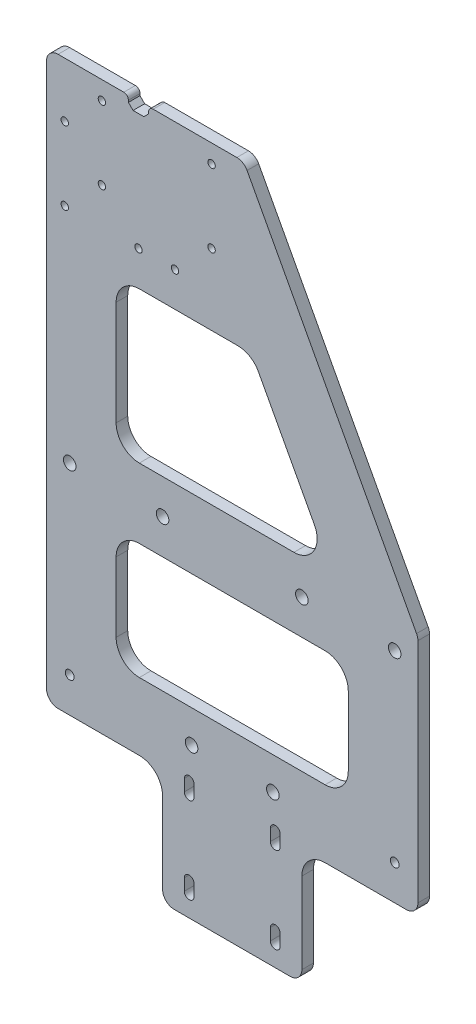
ISO-10303-21;
HEADER;
FILE_DESCRIPTION(('STEP AP214'),'2;1');
FILE_NAME('part.step','',(''),(''),'','','');
FILE_SCHEMA(('AUTOMOTIVE_DESIGN { 1 0 10303 214 1 1 1 1 }'));
ENDSEC;
DATA;
#1=APPLICATION_CONTEXT('core data for automotive mechanical design processes');
#2=APPLICATION_PROTOCOL_DEFINITION('international standard','automotive_design',2000,#1);
#3=PRODUCT_CONTEXT('',#1,'mechanical');
#4=PRODUCT('Part','Part','',(#3));
#5=PRODUCT_RELATED_PRODUCT_CATEGORY('part','',(#4));
#6=PRODUCT_DEFINITION_FORMATION('','',#4);
#7=PRODUCT_DEFINITION_CONTEXT('part definition',#1,'design');
#8=PRODUCT_DEFINITION('design','',#6,#7);
#9=PRODUCT_DEFINITION_SHAPE('','',#8);
#10=(LENGTH_UNIT() NAMED_UNIT(*) SI_UNIT(.MILLI.,.METRE.));
#11=(NAMED_UNIT(*) PLANE_ANGLE_UNIT() SI_UNIT($,.RADIAN.));
#12=(NAMED_UNIT(*) SI_UNIT($,.STERADIAN.) SOLID_ANGLE_UNIT());
#13=UNCERTAINTY_MEASURE_WITH_UNIT(LENGTH_MEASURE(1.E-05),#10,'distance_accuracy_value','');
#14=(GEOMETRIC_REPRESENTATION_CONTEXT(3) GLOBAL_UNCERTAINTY_ASSIGNED_CONTEXT((#13)) GLOBAL_UNIT_ASSIGNED_CONTEXT((#10,
#11,#12)) REPRESENTATION_CONTEXT('',''));
#15=CARTESIAN_POINT('',(0.,0.,0.));
#16=DIRECTION('',(0.,0.,1.));
#17=DIRECTION('',(1.,0.,0.));
#18=AXIS2_PLACEMENT_3D('',#15,#16,#17);
#19=CARTESIAN_POINT('',(0.,-203.2,6.35));
#20=DIRECTION('',(0.,0.,1.));
#21=DIRECTION('',(1.,0.,0.));
#22=AXIS2_PLACEMENT_3D('',#19,#20,#21);
#23=PLANE('',#22);
#24=CARTESIAN_POINT('',(12.7,-113.03,6.35));
#25=DIRECTION('',(0.,0.,1.));
#26=DIRECTION('',(1.,0.,0.));
#27=AXIS2_PLACEMENT_3D('',#24,#25,#26);
#28=CIRCLE('',#27,2.413);
#29=CARTESIAN_POINT('',(15.113,-113.03,6.35));
#30=VERTEX_POINT('',#29);
#31=EDGE_CURVE('E542',#30,#30,#28,.T.);
#32=ORIENTED_EDGE('',*,*,#31,.F.);
#33=EDGE_LOOP('',(#32));
#34=FACE_BOUND('',#33,.T.);
#35=CARTESIAN_POINT('',(12.7,-12.7,6.35));
#36=DIRECTION('',(0.,0.,1.));
#37=DIRECTION('',(1.,0.,0.));
#38=AXIS2_PLACEMENT_3D('',#35,#36,#37);
#39=CIRCLE('',#38,3.429);
#40=CARTESIAN_POINT('',(16.129,-12.7,6.35));
#41=VERTEX_POINT('',#40);
#42=EDGE_CURVE('E554',#41,#41,#39,.T.);
#43=ORIENTED_EDGE('',*,*,#42,.F.);
#44=EDGE_LOOP('',(#43));
#45=FACE_BOUND('',#44,.T.);
#46=CARTESIAN_POINT('',(190.5,-12.7,6.35));
#47=DIRECTION('',(0.,0.,1.));
#48=DIRECTION('',(-1.,0.,0.));
#49=AXIS2_PLACEMENT_3D('',#46,#47,#48);
#50=CIRCLE('',#49,3.429);
#51=CARTESIAN_POINT('',(187.071,-12.7,6.35));
#52=VERTEX_POINT('',#51);
#53=EDGE_CURVE('E566',#52,#52,#50,.T.);
#54=ORIENTED_EDGE('',*,*,#53,.F.);
#55=EDGE_LOOP('',(#54));
#56=FACE_BOUND('',#55,.T.);
#57=CARTESIAN_POINT('',(79.375,-113.03,6.35));
#58=DIRECTION('',(0.,0.,1.));
#59=DIRECTION('',(1.,0.,0.));
#60=AXIS2_PLACEMENT_3D('',#57,#58,#59);
#61=CIRCLE('',#60,3.429);
#62=CARTESIAN_POINT('',(82.804,-113.03,6.35));
#63=VERTEX_POINT('',#62);
#64=EDGE_CURVE('E578',#63,#63,#61,.T.);
#65=ORIENTED_EDGE('',*,*,#64,.F.);
#66=EDGE_LOOP('',(#65));
#67=FACE_BOUND('',#66,.T.);
#68=CARTESIAN_POINT('',(63.5,-12.7,6.35));
#69=DIRECTION('',(0.,0.,1.));
#70=DIRECTION('',(1.,0.,0.));
#71=AXIS2_PLACEMENT_3D('',#68,#69,#70);
#72=CIRCLE('',#71,3.429);
#73=CARTESIAN_POINT('',(66.929,-12.7,6.35));
#74=VERTEX_POINT('',#73);
#75=EDGE_CURVE('E584',#74,#74,#72,.T.);
#76=ORIENTED_EDGE('',*,*,#75,.F.);
#77=EDGE_LOOP('',(#76));
#78=FACE_BOUND('',#77,.T.);
#79=CARTESIAN_POINT('',(190.5,-113.03,6.35));
#80=DIRECTION('',(0.,0.,1.));
#81=DIRECTION('',(-1.,0.,0.));
#82=AXIS2_PLACEMENT_3D('',#79,#80,#81);
#83=CIRCLE('',#82,2.41299999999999);
#84=CARTESIAN_POINT('',(188.087,-113.03,6.35));
#85=VERTEX_POINT('',#84);
#86=EDGE_CURVE('E572',#85,#85,#83,.T.);
#87=ORIENTED_EDGE('',*,*,#86,.F.);
#88=EDGE_LOOP('',(#87));
#89=FACE_BOUND('',#88,.T.);
#90=CARTESIAN_POINT('',(123.825,-113.03,6.35));
#91=DIRECTION('',(0.,0.,1.));
#92=DIRECTION('',(-1.,0.,0.));
#93=AXIS2_PLACEMENT_3D('',#90,#91,#92);
#94=CIRCLE('',#93,3.42900000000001);
#95=CARTESIAN_POINT('',(120.396,-113.03,6.35));
#96=VERTEX_POINT('',#95);
#97=EDGE_CURVE('E560',#96,#96,#94,.T.);
#98=ORIENTED_EDGE('',*,*,#97,.F.);
#99=EDGE_LOOP('',(#98));
#100=FACE_BOUND('',#99,.T.);
#101=CARTESIAN_POINT('',(139.7,-12.7,6.35));
#102=DIRECTION('',(0.,0.,1.));
#103=DIRECTION('',(-1.,0.,0.));
#104=AXIS2_PLACEMENT_3D('',#101,#102,#103);
#105=CIRCLE('',#104,3.429);
#106=CARTESIAN_POINT('',(136.271,-12.7,6.35));
#107=VERTEX_POINT('',#106);
#108=EDGE_CURVE('E548',#107,#107,#105,.T.);
#109=ORIENTED_EDGE('',*,*,#108,.F.);
#110=EDGE_LOOP('',(#109));
#111=FACE_BOUND('',#110,.T.);
#112=CARTESIAN_POINT('',(78.0542,-130.7592,6.35));
#113=DIRECTION('',(0.,0.,1.));
#114=DIRECTION('',(1.,0.,0.));
#115=AXIS2_PLACEMENT_3D('',#112,#113,#114);
#116=CIRCLE('',#115,2.667);
#117=CARTESIAN_POINT('',(80.7212,-130.7592,6.35));
#118=VERTEX_POINT('',#117);
#119=CARTESIAN_POINT('',(75.3872,-130.7592,6.35));
#120=VERTEX_POINT('',#119);
#121=EDGE_CURVE('E503',#118,#120,#116,.T.);
#122=ORIENTED_EDGE('',*,*,#121,.F.);
#123=DIRECTION('',(0.,1.,0.));
#124=VECTOR('',#123,1.);
#125=CARTESIAN_POINT('',(80.7212,-130.7592,6.35));
#126=LINE('',#125,#124);
#127=CARTESIAN_POINT('',(80.7212,-137.1092,6.35));
#128=VERTEX_POINT('',#127);
#129=EDGE_CURVE('E514',#128,#118,#126,.T.);
#130=ORIENTED_EDGE('',*,*,#129,.F.);
#131=CARTESIAN_POINT('',(78.0542,-137.1092,6.35));
#132=DIRECTION('',(0.,0.,1.));
#133=DIRECTION('',(1.,0.,0.));
#134=AXIS2_PLACEMENT_3D('',#131,#132,#133);
#135=CIRCLE('',#134,2.667);
#136=CARTESIAN_POINT('',(75.3872,-137.1092,6.35));
#137=VERTEX_POINT('',#136);
#138=EDGE_CURVE('E528',#137,#128,#135,.T.);
#139=ORIENTED_EDGE('',*,*,#138,.F.);
#140=DIRECTION('',(0.,-1.,0.));
#141=VECTOR('',#140,1.);
#142=CARTESIAN_POINT('',(75.3872,-130.7592,6.35));
#143=LINE('',#142,#141);
#144=EDGE_CURVE('E525',#120,#137,#143,.T.);
#145=ORIENTED_EDGE('',*,*,#144,.F.);
#146=EDGE_LOOP('',(#122,#130,#139,#145));
#147=FACE_BOUND('',#146,.T.);
#148=CARTESIAN_POINT('',(78.0542,-177.8508,6.35));
#149=DIRECTION('',(0.,0.,1.));
#150=DIRECTION('',(1.,0.,0.));
#151=AXIS2_PLACEMENT_3D('',#148,#149,#150);
#152=CIRCLE('',#151,2.66700000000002);
#153=CARTESIAN_POINT('',(80.7212,-177.8508,6.35));
#154=VERTEX_POINT('',#153);
#155=CARTESIAN_POINT('',(75.3872,-177.8508,6.35));
#156=VERTEX_POINT('',#155);
#157=EDGE_CURVE('E471',#154,#156,#152,.T.);
#158=ORIENTED_EDGE('',*,*,#157,.F.);
#159=DIRECTION('',(0.,1.,0.));
#160=VECTOR('',#159,1.);
#161=CARTESIAN_POINT('',(80.7212,-177.8508,6.35));
#162=LINE('',#161,#160);
#163=CARTESIAN_POINT('',(80.7212,-184.2008,6.35));
#164=VERTEX_POINT('',#163);
#165=EDGE_CURVE('E482',#164,#154,#162,.T.);
#166=ORIENTED_EDGE('',*,*,#165,.F.);
#167=CARTESIAN_POINT('',(78.0542,-184.2008,6.35));
#168=DIRECTION('',(0.,0.,1.));
#169=DIRECTION('',(1.,0.,0.));
#170=AXIS2_PLACEMENT_3D('',#167,#168,#169);
#171=CIRCLE('',#170,2.66700000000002);
#172=CARTESIAN_POINT('',(75.3872,-184.2008,6.35));
#173=VERTEX_POINT('',#172);
#174=EDGE_CURVE('E496',#173,#164,#171,.T.);
#175=ORIENTED_EDGE('',*,*,#174,.F.);
#176=DIRECTION('',(0.,-1.,0.));
#177=VECTOR('',#176,1.);
#178=CARTESIAN_POINT('',(75.3872,-177.8508,6.35));
#179=LINE('',#178,#177);
#180=EDGE_CURVE('E493',#156,#173,#179,.T.);
#181=ORIENTED_EDGE('',*,*,#180,.F.);
#182=EDGE_LOOP('',(#158,#166,#175,#181));
#183=FACE_BOUND('',#182,.T.);
#184=CARTESIAN_POINT('',(125.1458,-130.7592,6.35));
#185=DIRECTION('',(0.,0.,1.));
#186=DIRECTION('',(1.,0.,0.));
#187=AXIS2_PLACEMENT_3D('',#184,#185,#186);
#188=CIRCLE('',#187,2.667);
#189=CARTESIAN_POINT('',(127.8128,-130.7592,6.35));
#190=VERTEX_POINT('',#189);
#191=CARTESIAN_POINT('',(122.4788,-130.7592,6.35));
#192=VERTEX_POINT('',#191);
#193=EDGE_CURVE('E442',#190,#192,#188,.T.);
#194=ORIENTED_EDGE('',*,*,#193,.F.);
#195=DIRECTION('',(0.,1.,0.));
#196=VECTOR('',#195,1.);
#197=CARTESIAN_POINT('',(127.8128,-130.7592,6.35));
#198=LINE('',#197,#196);
#199=CARTESIAN_POINT('',(127.8128,-137.1092,6.35));
#200=VERTEX_POINT('',#199);
#201=EDGE_CURVE('E450',#200,#190,#198,.T.);
#202=ORIENTED_EDGE('',*,*,#201,.F.);
#203=CARTESIAN_POINT('',(125.1458,-137.1092,6.35));
#204=DIRECTION('',(0.,0.,1.));
#205=DIRECTION('',(1.,0.,0.));
#206=AXIS2_PLACEMENT_3D('',#203,#204,#205);
#207=CIRCLE('',#206,2.667);
#208=CARTESIAN_POINT('',(122.4788,-137.1092,6.35));
#209=VERTEX_POINT('',#208);
#210=EDGE_CURVE('E464',#209,#200,#207,.T.);
#211=ORIENTED_EDGE('',*,*,#210,.F.);
#212=DIRECTION('',(0.,-1.,0.));
#213=VECTOR('',#212,1.);
#214=CARTESIAN_POINT('',(122.4788,-130.7592,6.35));
#215=LINE('',#214,#213);
#216=EDGE_CURVE('E461',#192,#209,#215,.T.);
#217=ORIENTED_EDGE('',*,*,#216,.F.);
#218=EDGE_LOOP('',(#194,#202,#211,#217));
#219=FACE_BOUND('',#218,.T.);
#220=CARTESIAN_POINT('',(125.1458,-177.8508,6.35));
#221=DIRECTION('',(0.,0.,1.));
#222=DIRECTION('',(1.,0.,0.));
#223=AXIS2_PLACEMENT_3D('',#220,#221,#222);
#224=CIRCLE('',#223,2.66699999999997);
#225=CARTESIAN_POINT('',(127.8128,-177.8508,6.35));
#226=VERTEX_POINT('',#225);
#227=CARTESIAN_POINT('',(122.4788,-177.8508,6.35));
#228=VERTEX_POINT('',#227);
#229=EDGE_CURVE('E405',#226,#228,#224,.T.);
#230=ORIENTED_EDGE('',*,*,#229,.F.);
#231=DIRECTION('',(0.,1.,0.));
#232=VECTOR('',#231,1.);
#233=CARTESIAN_POINT('',(127.8128,-177.8508,6.35));
#234=LINE('',#233,#232);
#235=CARTESIAN_POINT('',(127.8128,-184.2008,6.35));
#236=VERTEX_POINT('',#235);
#237=EDGE_CURVE('E423',#236,#226,#234,.T.);
#238=ORIENTED_EDGE('',*,*,#237,.F.);
#239=CARTESIAN_POINT('',(125.1458,-184.2008,6.35));
#240=DIRECTION('',(0.,0.,1.));
#241=DIRECTION('',(1.,0.,0.));
#242=AXIS2_PLACEMENT_3D('',#239,#240,#241);
#243=CIRCLE('',#242,2.66699999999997);
#244=CARTESIAN_POINT('',(122.4788,-184.2008,6.35));
#245=VERTEX_POINT('',#244);
#246=EDGE_CURVE('E426',#245,#236,#243,.T.);
#247=ORIENTED_EDGE('',*,*,#246,.F.);
#248=DIRECTION('',(0.,-1.,0.));
#249=VECTOR('',#248,1.);
#250=CARTESIAN_POINT('',(122.4788,-177.8508,6.35));
#251=LINE('',#250,#249);
#252=EDGE_CURVE('E435',#228,#245,#251,.T.);
#253=ORIENTED_EDGE('',*,*,#252,.F.);
#254=EDGE_LOOP('',(#230,#238,#247,#253));
#255=FACE_BOUND('',#254,.T.);
#256=CARTESIAN_POINT('',(70.325000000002,107.800000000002,6.35));
#257=DIRECTION('',(0.,0.,1.));
#258=DIRECTION('',(1.,0.,0.));
#259=AXIS2_PLACEMENT_3D('',#256,#257,#258);
#260=CIRCLE('',#259,2.0193);
#261=CARTESIAN_POINT('',(72.344300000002,107.800000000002,6.35));
#262=VERTEX_POINT('',#261);
#263=EDGE_CURVE('E907',#262,#262,#260,.T.);
#264=ORIENTED_EDGE('',*,*,#263,.F.);
#265=EDGE_LOOP('',(#264));
#266=FACE_BOUND('',#265,.T.);
#267=CARTESIAN_POINT('',(50.3249999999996,107.8,6.35));
#268=DIRECTION('',(0.,0.,1.));
#269=DIRECTION('',(1.,0.,0.));
#270=AXIS2_PLACEMENT_3D('',#267,#268,#269);
#271=CIRCLE('',#270,2.0193);
#272=CARTESIAN_POINT('',(52.3442999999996,107.8,6.35));
#273=VERTEX_POINT('',#272);
#274=EDGE_CURVE('E901',#273,#273,#271,.T.);
#275=ORIENTED_EDGE('',*,*,#274,.F.);
#276=EDGE_LOOP('',(#275));
#277=FACE_BOUND('',#276,.T.);
#278=CARTESIAN_POINT('',(90.324999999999,167.8,6.35));
#279=DIRECTION('',(0.,0.,1.));
#280=DIRECTION('',(1.,0.,0.));
#281=AXIS2_PLACEMENT_3D('',#278,#279,#280);
#282=CIRCLE('',#281,2.0193);
#283=CARTESIAN_POINT('',(92.344299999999,167.8,6.35));
#284=VERTEX_POINT('',#283);
#285=EDGE_CURVE('E895',#284,#284,#282,.T.);
#286=ORIENTED_EDGE('',*,*,#285,.F.);
#287=EDGE_LOOP('',(#286));
#288=FACE_BOUND('',#287,.T.);
#289=CARTESIAN_POINT('',(90.3250000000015,127.800000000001,6.35));
#290=DIRECTION('',(0.,0.,1.));
#291=DIRECTION('',(1.,0.,0.));
#292=AXIS2_PLACEMENT_3D('',#289,#290,#291);
#293=CIRCLE('',#292,2.0193);
#294=CARTESIAN_POINT('',(92.3443000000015,127.800000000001,6.35));
#295=VERTEX_POINT('',#294);
#296=EDGE_CURVE('E889',#295,#295,#293,.T.);
#297=ORIENTED_EDGE('',*,*,#296,.F.);
#298=EDGE_LOOP('',(#297));
#299=FACE_BOUND('',#298,.T.);
#300=CARTESIAN_POINT('',(30.3250000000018,127.800000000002,6.35));
#301=DIRECTION('',(0.,0.,1.));
#302=DIRECTION('',(1.,0.,0.));
#303=AXIS2_PLACEMENT_3D('',#300,#301,#302);
#304=CIRCLE('',#303,2.0193);
#305=CARTESIAN_POINT('',(32.3443000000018,127.800000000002,6.35));
#306=VERTEX_POINT('',#305);
#307=EDGE_CURVE('E883',#306,#306,#304,.T.);
#308=ORIENTED_EDGE('',*,*,#307,.F.);
#309=EDGE_LOOP('',(#308));
#310=FACE_BOUND('',#309,.T.);
#311=CARTESIAN_POINT('',(9.99999999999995,107.8,6.35));
#312=DIRECTION('',(0.,0.,1.));
#313=DIRECTION('',(1.,0.,0.));
#314=AXIS2_PLACEMENT_3D('',#311,#312,#313);
#315=CIRCLE('',#314,2.0193);
#316=CARTESIAN_POINT('',(12.0192999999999,107.8,6.35));
#317=VERTEX_POINT('',#316);
#318=EDGE_CURVE('E877',#317,#317,#315,.T.);
#319=ORIENTED_EDGE('',*,*,#318,.F.);
#320=EDGE_LOOP('',(#319));
#321=FACE_BOUND('',#320,.T.);
#322=CARTESIAN_POINT('',(10.0000000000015,147.8,6.35));
#323=DIRECTION('',(0.,0.,1.));
#324=DIRECTION('',(1.,0.,0.));
#325=AXIS2_PLACEMENT_3D('',#322,#323,#324);
#326=CIRCLE('',#325,2.0193);
#327=CARTESIAN_POINT('',(12.0193000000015,147.8,6.35));
#328=VERTEX_POINT('',#327);
#329=EDGE_CURVE('E871',#328,#328,#326,.T.);
#330=ORIENTED_EDGE('',*,*,#329,.F.);
#331=EDGE_LOOP('',(#330));
#332=FACE_BOUND('',#331,.T.);
#333=CARTESIAN_POINT('',(30.3249999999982,167.8,6.35));
#334=DIRECTION('',(0.,0.,1.));
#335=DIRECTION('',(1.,0.,0.));
#336=AXIS2_PLACEMENT_3D('',#333,#334,#335);
#337=CIRCLE('',#336,2.0193);
#338=CARTESIAN_POINT('',(32.3442999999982,167.8,6.35));
#339=VERTEX_POINT('',#338);
#340=EDGE_CURVE('E855',#339,#339,#337,.T.);
#341=ORIENTED_EDGE('',*,*,#340,.F.);
#342=EDGE_LOOP('',(#341));
#343=FACE_BOUND('',#342,.T.);
#344=DIRECTION('',(0.,-1.,0.));
#345=VECTOR('',#344,1.);
#346=CARTESIAN_POINT('',(38.1,88.9,6.35));
#347=LINE('',#346,#345);
#348=CARTESIAN_POINT('',(38.1,76.2,6.35));
#349=VERTEX_POINT('',#348);
#350=CARTESIAN_POINT('',(38.1,19.05,6.35));
#351=VERTEX_POINT('',#350);
#352=EDGE_CURVE('E831',#349,#351,#347,.T.);
#353=ORIENTED_EDGE('',*,*,#352,.F.);
#354=CARTESIAN_POINT('',(50.8,76.2,6.35));
#355=DIRECTION('',(0.,0.,1.));
#356=DIRECTION('',(1.,0.,0.));
#357=AXIS2_PLACEMENT_3D('',#354,#355,#356);
#358=CIRCLE('',#357,12.7);
#359=CARTESIAN_POINT('',(50.8,88.9,6.35));
#360=VERTEX_POINT('',#359);
#361=EDGE_CURVE('E754',#349,#360,#358,.F.);
#362=ORIENTED_EDGE('',*,*,#361,.T.);
#363=DIRECTION('',(-1.,0.,0.));
#364=VECTOR('',#363,1.);
#365=CARTESIAN_POINT('',(38.1,88.9,6.35));
#366=LINE('',#365,#364);
#367=CARTESIAN_POINT('',(104.748220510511,88.9,6.35));
#368=VERTEX_POINT('',#367);
#369=EDGE_CURVE('E846',#368,#360,#366,.T.);
#370=ORIENTED_EDGE('',*,*,#369,.F.);
#371=CARTESIAN_POINT('',(104.748220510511,76.2,6.35));
#372=DIRECTION('',(0.,0.,1.));
#373=DIRECTION('',(1.,0.,0.));
#374=AXIS2_PLACEMENT_3D('',#371,#372,#373);
#375=CIRCLE('',#374,12.7);
#376=CARTESIAN_POINT('',(115.943016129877,82.1972119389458,6.35));
#377=VERTEX_POINT('',#376);
#378=EDGE_CURVE('E750',#368,#377,#375,.F.);
#379=ORIENTED_EDGE('',*,*,#378,.T.);
#380=DIRECTION('',(-0.472221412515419,0.881479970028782,0.));
#381=VECTOR('',#380,1.);
#382=CARTESIAN_POINT('',(112.352236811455,88.9,6.35));
#383=LINE('',#382,#381);
#384=CARTESIAN_POINT('',(146.559087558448,25.0472119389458,6.35));
#385=VERTEX_POINT('',#384);
#386=EDGE_CURVE('E861',#385,#377,#383,.T.);
#387=ORIENTED_EDGE('',*,*,#386,.F.);
#388=CARTESIAN_POINT('',(135.364291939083,19.05,6.35));
#389=DIRECTION('',(0.,0.,1.));
#390=DIRECTION('',(1.,0.,0.));
#391=AXIS2_PLACEMENT_3D('',#388,#389,#390);
#392=CIRCLE('',#391,12.7);
#393=CARTESIAN_POINT('',(135.364291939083,6.34999999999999,6.35));
#394=VERTEX_POINT('',#393);
#395=EDGE_CURVE('E742',#385,#394,#392,.F.);
#396=ORIENTED_EDGE('',*,*,#395,.T.);
#397=DIRECTION('',(1.,0.,0.));
#398=VECTOR('',#397,1.);
#399=CARTESIAN_POINT('',(38.1,6.34999999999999,6.35));
#400=LINE('',#399,#398);
#401=CARTESIAN_POINT('',(50.8,6.34999999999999,6.35));
#402=VERTEX_POINT('',#401);
#403=EDGE_CURVE('E858',#402,#394,#400,.T.);
#404=ORIENTED_EDGE('',*,*,#403,.F.);
#405=CARTESIAN_POINT('',(50.8,19.05,6.35));
#406=DIRECTION('',(0.,0.,1.));
#407=DIRECTION('',(1.,0.,0.));
#408=AXIS2_PLACEMENT_3D('',#405,#406,#407);
#409=CIRCLE('',#408,12.7);
#410=EDGE_CURVE('E746',#402,#351,#409,.F.);
#411=ORIENTED_EDGE('',*,*,#410,.T.);
#412=EDGE_LOOP('',(#353,#362,#370,#379,#387,#396,#404,#411));
#413=FACE_BOUND('',#412,.T.);
#414=DIRECTION('',(0.,-1.,0.));
#415=VECTOR('',#414,1.);
#416=CARTESIAN_POINT('',(38.1,-31.75,6.35));
#417=LINE('',#416,#415);
#418=CARTESIAN_POINT('',(38.1,-44.45,6.35));
#419=VERTEX_POINT('',#418);
#420=CARTESIAN_POINT('',(38.1,-82.55,6.35));
#421=VERTEX_POINT('',#420);
#422=EDGE_CURVE('E814',#419,#421,#417,.T.);
#423=ORIENTED_EDGE('',*,*,#422,.F.);
#424=CARTESIAN_POINT('',(50.8,-44.45,6.35));
#425=DIRECTION('',(0.,0.,1.));
#426=DIRECTION('',(1.,0.,0.));
#427=AXIS2_PLACEMENT_3D('',#424,#425,#426);
#428=CIRCLE('',#427,12.7);
#429=CARTESIAN_POINT('',(50.8,-31.75,6.35));
#430=VERTEX_POINT('',#429);
#431=EDGE_CURVE('E734',#419,#430,#428,.F.);
#432=ORIENTED_EDGE('',*,*,#431,.T.);
#433=DIRECTION('',(-1.,0.,0.));
#434=VECTOR('',#433,1.);
#435=CARTESIAN_POINT('',(38.1,-31.75,6.35));
#436=LINE('',#435,#434);
#437=CARTESIAN_POINT('',(152.4,-31.75,6.35));
#438=VERTEX_POINT('',#437);
#439=EDGE_CURVE('E822',#438,#430,#436,.T.);
#440=ORIENTED_EDGE('',*,*,#439,.F.);
#441=CARTESIAN_POINT('',(152.4,-44.45,6.35));
#442=DIRECTION('',(0.,0.,1.));
#443=DIRECTION('',(1.,0.,0.));
#444=AXIS2_PLACEMENT_3D('',#441,#442,#443);
#445=CIRCLE('',#444,12.7);
#446=CARTESIAN_POINT('',(165.1,-44.45,6.35));
#447=VERTEX_POINT('',#446);
#448=EDGE_CURVE('E738',#438,#447,#445,.F.);
#449=ORIENTED_EDGE('',*,*,#448,.T.);
#450=DIRECTION('',(0.,1.,0.));
#451=VECTOR('',#450,1.);
#452=CARTESIAN_POINT('',(165.1,-31.75,6.35));
#453=LINE('',#452,#451);
#454=CARTESIAN_POINT('',(165.1,-82.55,6.35));
#455=VERTEX_POINT('',#454);
#456=EDGE_CURVE('E837',#455,#447,#453,.T.);
#457=ORIENTED_EDGE('',*,*,#456,.F.);
#458=CARTESIAN_POINT('',(152.4,-82.55,6.35));
#459=DIRECTION('',(0.,0.,1.));
#460=DIRECTION('',(1.,0.,0.));
#461=AXIS2_PLACEMENT_3D('',#458,#459,#460);
#462=CIRCLE('',#461,12.7);
#463=CARTESIAN_POINT('',(152.4,-95.25,6.35));
#464=VERTEX_POINT('',#463);
#465=EDGE_CURVE('E726',#455,#464,#462,.F.);
#466=ORIENTED_EDGE('',*,*,#465,.T.);
#467=DIRECTION('',(1.,0.,0.));
#468=VECTOR('',#467,1.);
#469=CARTESIAN_POINT('',(38.1,-95.25,6.35));
#470=LINE('',#469,#468);
#471=CARTESIAN_POINT('',(50.8,-95.25,6.35));
#472=VERTEX_POINT('',#471);
#473=EDGE_CURVE('E834',#472,#464,#470,.T.);
#474=ORIENTED_EDGE('',*,*,#473,.F.);
#475=CARTESIAN_POINT('',(50.8,-82.55,6.35));
#476=DIRECTION('',(0.,0.,1.));
#477=DIRECTION('',(1.,0.,0.));
#478=AXIS2_PLACEMENT_3D('',#475,#476,#477);
#479=CIRCLE('',#478,12.7);
#480=EDGE_CURVE('E730',#472,#421,#479,.F.);
#481=ORIENTED_EDGE('',*,*,#480,.T.);
#482=EDGE_LOOP('',(#423,#432,#440,#449,#457,#466,#474,#481));
#483=FACE_BOUND('',#482,.T.);
#484=DIRECTION('',(1.,0.,0.));
#485=VECTOR('',#484,1.);
#486=CARTESIAN_POINT('',(-229.185085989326,177.8,6.35000000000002));
#487=LINE('',#486,#485);
#488=CARTESIAN_POINT('',(58.3643398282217,177.8,6.35000000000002));
#489=VERTEX_POINT('',#488);
#490=CARTESIAN_POINT('',(104.147991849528,177.8,6.35000000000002));
#491=VERTEX_POINT('',#490);
#492=EDGE_CURVE('E917',#489,#491,#487,.T.);
#493=ORIENTED_EDGE('',*,*,#492,.F.);
#494=CARTESIAN_POINT('',(58.3643398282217,175.26,6.35000000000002));
#495=DIRECTION('',(0.,0.,1.));
#496=DIRECTION('',(1.,0.,0.));
#497=AXIS2_PLACEMENT_3D('',#494,#495,#496);
#498=CIRCLE('',#497,2.54);
#499=CARTESIAN_POINT('',(55.8243398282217,175.26,6.35));
#500=VERTEX_POINT('',#499);
#501=EDGE_CURVE('E763',#489,#500,#498,.T.);
#502=ORIENTED_EDGE('',*,*,#501,.T.);
#503=DIRECTION('',(0.,-1.,0.));
#504=VECTOR('',#503,1.);
#505=CARTESIAN_POINT('',(55.8243398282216,101.589593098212,6.35));
#506=LINE('',#505,#504);
#507=CARTESIAN_POINT('',(55.8243398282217,174.240660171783,6.35));
#508=VERTEX_POINT('',#507);
#509=EDGE_CURVE('E795',#500,#508,#506,.T.);
#510=ORIENTED_EDGE('',*,*,#509,.T.);
#511=DIRECTION('',(-0.707106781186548,-0.707106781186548,0.));
#512=VECTOR('',#511,1.);
#513=CARTESIAN_POINT('',(55.8243398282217,174.240660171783,6.35));
#514=LINE('',#513,#512);
#515=CARTESIAN_POINT('',(53.2843398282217,171.700660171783,6.35));
#516=VERTEX_POINT('',#515);
#517=EDGE_CURVE('E41',#508,#516,#514,.T.);
#518=ORIENTED_EDGE('',*,*,#517,.T.);
#519=DIRECTION('',(1.,0.,0.));
#520=VECTOR('',#519,1.);
#521=CARTESIAN_POINT('',(55.2489959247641,171.700660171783,6.35));
#522=LINE('',#521,#520);
#523=CARTESIAN_POINT('',(47.3656601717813,171.700660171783,6.35));
#524=VERTEX_POINT('',#523);
#525=EDGE_CURVE('E793',#524,#516,#522,.T.);
#526=ORIENTED_EDGE('',*,*,#525,.F.);
#527=DIRECTION('',(0.707106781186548,-0.707106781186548,0.));
#528=VECTOR('',#527,1.);
#529=CARTESIAN_POINT('',(47.3656601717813,171.700660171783,6.35));
#530=LINE('',#529,#528);
#531=CARTESIAN_POINT('',(44.8256601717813,174.240660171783,6.35));
#532=VERTEX_POINT('',#531);
#533=EDGE_CURVE('E785',#524,#532,#530,.F.);
#534=ORIENTED_EDGE('',*,*,#533,.T.);
#535=DIRECTION('',(0.,-1.,0.));
#536=VECTOR('',#535,1.);
#537=CARTESIAN_POINT('',(44.8256601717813,101.589593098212,6.35));
#538=LINE('',#537,#536);
#539=CARTESIAN_POINT('',(44.8256601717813,175.26,6.35));
#540=VERTEX_POINT('',#539);
#541=EDGE_CURVE('E801',#540,#532,#538,.T.);
#542=ORIENTED_EDGE('',*,*,#541,.F.);
#543=CARTESIAN_POINT('',(42.2856601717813,175.26,6.35));
#544=DIRECTION('',(0.,0.,1.));
#545=DIRECTION('',(1.,0.,0.));
#546=AXIS2_PLACEMENT_3D('',#543,#544,#545);
#547=CIRCLE('',#546,2.54);
#548=CARTESIAN_POINT('',(42.2856601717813,177.8,6.35000000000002));
#549=VERTEX_POINT('',#548);
#550=EDGE_CURVE('E761',#540,#549,#547,.T.);
#551=ORIENTED_EDGE('',*,*,#550,.T.);
#552=CARTESIAN_POINT('',(6.34999999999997,177.8,6.35000000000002));
#553=VERTEX_POINT('',#552);
#554=EDGE_CURVE('E921',#553,#549,#487,.T.);
#555=ORIENTED_EDGE('',*,*,#554,.F.);
#556=CARTESIAN_POINT('',(6.34999999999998,171.45,6.35));
#557=DIRECTION('',(0.,0.,1.));
#558=DIRECTION('',(1.,0.,0.));
#559=AXIS2_PLACEMENT_3D('',#556,#557,#558);
#560=CIRCLE('',#559,6.35);
#561=CARTESIAN_POINT('',(0.,171.45,6.35));
#562=VERTEX_POINT('',#561);
#563=EDGE_CURVE('E671',#553,#562,#560,.T.);
#564=ORIENTED_EDGE('',*,*,#563,.T.);
#565=DIRECTION('',(0.,-1.,0.));
#566=VECTOR('',#565,1.);
#567=CARTESIAN_POINT('',(0.,0.,6.35));
#568=LINE('',#567,#566);
#569=CARTESIAN_POINT('',(0.,-125.819783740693,6.35));
#570=VERTEX_POINT('',#569);
#571=EDGE_CURVE('E590',#562,#570,#568,.T.);
#572=ORIENTED_EDGE('',*,*,#571,.T.);
#573=CARTESIAN_POINT('',(6.35000000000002,-125.819783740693,6.35));
#574=DIRECTION('',(0.,0.,1.));
#575=DIRECTION('',(1.,0.,0.));
#576=AXIS2_PLACEMENT_3D('',#573,#574,#575);
#577=CIRCLE('',#576,6.35);
#578=CARTESIAN_POINT('',(6.35000000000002,-132.169783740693,6.35));
#579=VERTEX_POINT('',#578);
#580=EDGE_CURVE('E624',#570,#579,#577,.T.);
#581=ORIENTED_EDGE('',*,*,#580,.T.);
#582=DIRECTION('',(-1.,0.,0.));
#583=VECTOR('',#582,1.);
#584=CARTESIAN_POINT('',(0.,-132.169783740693,6.35));
#585=LINE('',#584,#583);
#586=CARTESIAN_POINT('',(50.8,-132.169783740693,6.35));
#587=VERTEX_POINT('',#586);
#588=EDGE_CURVE('E429',#587,#579,#585,.T.);
#589=ORIENTED_EDGE('',*,*,#588,.F.);
#590=CARTESIAN_POINT('',(50.8,-144.869783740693,6.35));
#591=DIRECTION('',(0.,0.,1.));
#592=DIRECTION('',(1.,0.,0.));
#593=AXIS2_PLACEMENT_3D('',#590,#591,#592);
#594=CIRCLE('',#593,12.7);
#595=CARTESIAN_POINT('',(63.5,-144.869783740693,6.35));
#596=VERTEX_POINT('',#595);
#597=EDGE_CURVE('E611',#587,#596,#594,.F.);
#598=ORIENTED_EDGE('',*,*,#597,.T.);
#599=DIRECTION('',(0.,1.,0.));
#600=VECTOR('',#599,1.);
#601=CARTESIAN_POINT('',(63.5,-132.169783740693,6.35));
#602=LINE('',#601,#600);
#603=CARTESIAN_POINT('',(63.5,-189.229999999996,6.35));
#604=VERTEX_POINT('',#603);
#605=EDGE_CURVE('E946',#604,#596,#602,.T.);
#606=ORIENTED_EDGE('',*,*,#605,.F.);
#607=CARTESIAN_POINT('',(69.85,-189.229999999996,6.35));
#608=DIRECTION('',(0.,0.,1.));
#609=DIRECTION('',(1.,0.,0.));
#610=AXIS2_PLACEMENT_3D('',#607,#608,#609);
#611=CIRCLE('',#610,6.35);
#612=CARTESIAN_POINT('',(69.85,-195.579999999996,6.35));
#613=VERTEX_POINT('',#612);
#614=EDGE_CURVE('E626',#604,#613,#611,.T.);
#615=ORIENTED_EDGE('',*,*,#614,.T.);
#616=DIRECTION('',(-1.,0.,0.));
#617=VECTOR('',#616,1.);
#618=CARTESIAN_POINT('',(63.5,-195.579999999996,6.35));
#619=LINE('',#618,#617);
#620=CARTESIAN_POINT('',(133.35,-195.579999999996,6.35));
#621=VERTEX_POINT('',#620);
#622=EDGE_CURVE('E944',#621,#613,#619,.T.);
#623=ORIENTED_EDGE('',*,*,#622,.F.);
#624=CARTESIAN_POINT('',(133.35,-189.229999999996,6.35));
#625=DIRECTION('',(0.,0.,1.));
#626=DIRECTION('',(1.,0.,0.));
#627=AXIS2_PLACEMENT_3D('',#624,#625,#626);
#628=CIRCLE('',#627,6.35);
#629=CARTESIAN_POINT('',(139.7,-189.229999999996,6.35));
#630=VERTEX_POINT('',#629);
#631=EDGE_CURVE('E628',#621,#630,#628,.T.);
#632=ORIENTED_EDGE('',*,*,#631,.T.);
#633=DIRECTION('',(0.,-1.,0.));
#634=VECTOR('',#633,1.);
#635=CARTESIAN_POINT('',(139.7,-195.579999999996,6.35));
#636=LINE('',#635,#634);
#637=CARTESIAN_POINT('',(139.7,-144.869783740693,6.35));
#638=VERTEX_POINT('',#637);
#639=EDGE_CURVE('E941',#638,#630,#636,.T.);
#640=ORIENTED_EDGE('',*,*,#639,.F.);
#641=CARTESIAN_POINT('',(152.4,-144.869783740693,6.35));
#642=DIRECTION('',(0.,0.,1.));
#643=DIRECTION('',(1.,0.,0.));
#644=AXIS2_PLACEMENT_3D('',#641,#642,#643);
#645=CIRCLE('',#644,12.7);
#646=CARTESIAN_POINT('',(152.4,-132.169783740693,6.35));
#647=VERTEX_POINT('',#646);
#648=EDGE_CURVE('E616',#638,#647,#645,.F.);
#649=ORIENTED_EDGE('',*,*,#648,.T.);
#650=DIRECTION('',(-1.,0.,0.));
#651=VECTOR('',#650,1.);
#652=CARTESIAN_POINT('',(139.7,-132.169783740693,6.35));
#653=LINE('',#652,#651);
#654=CARTESIAN_POINT('',(196.85,-132.169783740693,6.35));
#655=VERTEX_POINT('',#654);
#656=EDGE_CURVE('E927',#655,#647,#653,.T.);
#657=ORIENTED_EDGE('',*,*,#656,.F.);
#658=CARTESIAN_POINT('',(196.85,-125.819783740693,6.35));
#659=DIRECTION('',(0.,0.,1.));
#660=DIRECTION('',(1.,0.,0.));
#661=AXIS2_PLACEMENT_3D('',#658,#659,#660);
#662=CIRCLE('',#661,6.35);
#663=CARTESIAN_POINT('',(203.2,-125.819783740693,6.35));
#664=VERTEX_POINT('',#663);
#665=EDGE_CURVE('E630',#655,#664,#662,.T.);
#666=ORIENTED_EDGE('',*,*,#665,.T.);
#667=DIRECTION('',(0.,1.,0.));
#668=VECTOR('',#667,1.);
#669=CARTESIAN_POINT('',(203.2,0.,6.35));
#670=LINE('',#669,#668);
#671=CARTESIAN_POINT('',(203.2,-1.59374854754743,6.35));
#672=VERTEX_POINT('',#671);
#673=EDGE_CURVE('E592',#664,#672,#670,.T.);
#674=ORIENTED_EDGE('',*,*,#673,.T.);
#675=CARTESIAN_POINT('',(196.85,-1.59374854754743,6.35000000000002));
#676=DIRECTION('',(0.,0.,1.));
#677=DIRECTION('',(1.,0.,0.));
#678=AXIS2_PLACEMENT_3D('',#675,#676,#677);
#679=CIRCLE('',#678,6.35);
#680=CARTESIAN_POINT('',(202.447397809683,1.40485742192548,6.35000000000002));
#681=VERTEX_POINT('',#680);
#682=EDGE_CURVE('E676',#672,#681,#679,.T.);
#683=ORIENTED_EDGE('',*,*,#682,.T.);
#684=DIRECTION('',(0.472221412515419,-0.881479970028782,0.));
#685=VECTOR('',#684,1.);
#686=CARTESIAN_POINT('',(110.481621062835,173.074307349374,6.35000000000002));
#687=LINE('',#686,#685);
#688=CARTESIAN_POINT('',(109.745389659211,174.448605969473,6.35000000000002));
#689=VERTEX_POINT('',#688);
#690=EDGE_CURVE('E924',#689,#681,#687,.T.);
#691=ORIENTED_EDGE('',*,*,#690,.F.);
#692=CARTESIAN_POINT('',(104.147991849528,171.45,6.35000000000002));
#693=DIRECTION('',(0.,0.,1.));
#694=DIRECTION('',(1.,0.,0.));
#695=AXIS2_PLACEMENT_3D('',#692,#693,#694);
#696=CIRCLE('',#695,6.35);
#697=EDGE_CURVE('E673',#689,#491,#696,.T.);
#698=ORIENTED_EDGE('',*,*,#697,.T.);
#699=EDGE_LOOP('',(#493,#502,#510,#518,#526,#534,#542,#551,#555,#564,#572,#581,#589,#598,#606,
#615,#623,#632,#640,#649,#657,#666,#674,#683,#691,#698));
#700=FACE_BOUND('',#699,.T.);
#701=ADVANCED_FACE('F33',(#34,#45,#56,#67,#78,#89,#100,#111,#147,#183,#219,#255,#266,#277,#288,
#299,#310,#321,#332,#343,#413,#483,#700),#23,.T.);
#702=CARTESIAN_POINT('',(0.,-203.2,0.));
#703=DIRECTION('',(0.,0.,1.));
#704=DIRECTION('',(1.,0.,0.));
#705=AXIS2_PLACEMENT_3D('',#702,#703,#704);
#706=PLANE('',#705);
#707=CARTESIAN_POINT('',(12.7,-113.03,0.));
#708=DIRECTION('',(0.,0.,1.));
#709=DIRECTION('',(1.,0.,0.));
#710=AXIS2_PLACEMENT_3D('',#707,#708,#709);
#711=CIRCLE('',#710,2.413);
#712=CARTESIAN_POINT('',(15.113,-113.03,0.));
#713=VERTEX_POINT('',#712);
#714=EDGE_CURVE('E535',#713,#713,#711,.T.);
#715=ORIENTED_EDGE('',*,*,#714,.T.);
#716=EDGE_LOOP('',(#715));
#717=FACE_BOUND('',#716,.T.);
#718=CARTESIAN_POINT('',(12.7,-12.7,0.));
#719=DIRECTION('',(0.,0.,1.));
#720=DIRECTION('',(1.,0.,0.));
#721=AXIS2_PLACEMENT_3D('',#718,#719,#720);
#722=CIRCLE('',#721,3.429);
#723=CARTESIAN_POINT('',(16.129,-12.7,0.));
#724=VERTEX_POINT('',#723);
#725=EDGE_CURVE('E551',#724,#724,#722,.T.);
#726=ORIENTED_EDGE('',*,*,#725,.T.);
#727=EDGE_LOOP('',(#726));
#728=FACE_BOUND('',#727,.T.);
#729=CARTESIAN_POINT('',(190.5,-12.7,0.));
#730=DIRECTION('',(0.,0.,1.));
#731=DIRECTION('',(-1.,0.,0.));
#732=AXIS2_PLACEMENT_3D('',#729,#730,#731);
#733=CIRCLE('',#732,3.429);
#734=CARTESIAN_POINT('',(187.071,-12.7,0.));
#735=VERTEX_POINT('',#734);
#736=EDGE_CURVE('E563',#735,#735,#733,.T.);
#737=ORIENTED_EDGE('',*,*,#736,.T.);
#738=EDGE_LOOP('',(#737));
#739=FACE_BOUND('',#738,.T.);
#740=CARTESIAN_POINT('',(79.375,-113.03,0.));
#741=DIRECTION('',(0.,0.,1.));
#742=DIRECTION('',(1.,0.,0.));
#743=AXIS2_PLACEMENT_3D('',#740,#741,#742);
#744=CIRCLE('',#743,3.429);
#745=CARTESIAN_POINT('',(82.804,-113.03,0.));
#746=VERTEX_POINT('',#745);
#747=EDGE_CURVE('E575',#746,#746,#744,.T.);
#748=ORIENTED_EDGE('',*,*,#747,.T.);
#749=EDGE_LOOP('',(#748));
#750=FACE_BOUND('',#749,.T.);
#751=CARTESIAN_POINT('',(63.5,-12.7,0.));
#752=DIRECTION('',(0.,0.,1.));
#753=DIRECTION('',(1.,0.,0.));
#754=AXIS2_PLACEMENT_3D('',#751,#752,#753);
#755=CIRCLE('',#754,3.429);
#756=CARTESIAN_POINT('',(66.929,-12.7,0.));
#757=VERTEX_POINT('',#756);
#758=EDGE_CURVE('E581',#757,#757,#755,.T.);
#759=ORIENTED_EDGE('',*,*,#758,.T.);
#760=EDGE_LOOP('',(#759));
#761=FACE_BOUND('',#760,.T.);
#762=CARTESIAN_POINT('',(190.5,-113.03,0.));
#763=DIRECTION('',(0.,0.,1.));
#764=DIRECTION('',(-1.,0.,0.));
#765=AXIS2_PLACEMENT_3D('',#762,#763,#764);
#766=CIRCLE('',#765,2.41299999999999);
#767=CARTESIAN_POINT('',(188.087,-113.03,0.));
#768=VERTEX_POINT('',#767);
#769=EDGE_CURVE('E569',#768,#768,#766,.T.);
#770=ORIENTED_EDGE('',*,*,#769,.T.);
#771=EDGE_LOOP('',(#770));
#772=FACE_BOUND('',#771,.T.);
#773=CARTESIAN_POINT('',(123.825,-113.03,0.));
#774=DIRECTION('',(0.,0.,1.));
#775=DIRECTION('',(-1.,0.,0.));
#776=AXIS2_PLACEMENT_3D('',#773,#774,#775);
#777=CIRCLE('',#776,3.42900000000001);
#778=CARTESIAN_POINT('',(120.396,-113.03,0.));
#779=VERTEX_POINT('',#778);
#780=EDGE_CURVE('E557',#779,#779,#777,.T.);
#781=ORIENTED_EDGE('',*,*,#780,.T.);
#782=EDGE_LOOP('',(#781));
#783=FACE_BOUND('',#782,.T.);
#784=CARTESIAN_POINT('',(139.7,-12.7,0.));
#785=DIRECTION('',(0.,0.,1.));
#786=DIRECTION('',(-1.,0.,0.));
#787=AXIS2_PLACEMENT_3D('',#784,#785,#786);
#788=CIRCLE('',#787,3.429);
#789=CARTESIAN_POINT('',(136.271,-12.7,0.));
#790=VERTEX_POINT('',#789);
#791=EDGE_CURVE('E545',#790,#790,#788,.T.);
#792=ORIENTED_EDGE('',*,*,#791,.T.);
#793=EDGE_LOOP('',(#792));
#794=FACE_BOUND('',#793,.T.);
#795=DIRECTION('',(0.,1.,0.));
#796=VECTOR('',#795,1.);
#797=CARTESIAN_POINT('',(80.7212,-130.7592,0.));
#798=LINE('',#797,#796);
#799=CARTESIAN_POINT('',(80.7212,-137.1092,0.));
#800=VERTEX_POINT('',#799);
#801=CARTESIAN_POINT('',(80.7212,-130.7592,0.));
#802=VERTEX_POINT('',#801);
#803=EDGE_CURVE('E520',#800,#802,#798,.T.);
#804=ORIENTED_EDGE('',*,*,#803,.T.);
#805=CARTESIAN_POINT('',(78.0542,-130.7592,0.));
#806=DIRECTION('',(0.,0.,1.));
#807=DIRECTION('',(1.,0.,0.));
#808=AXIS2_PLACEMENT_3D('',#805,#806,#807);
#809=CIRCLE('',#808,2.667);
#810=CARTESIAN_POINT('',(75.3872,-130.7592,0.));
#811=VERTEX_POINT('',#810);
#812=EDGE_CURVE('E510',#802,#811,#809,.T.);
#813=ORIENTED_EDGE('',*,*,#812,.T.);
#814=DIRECTION('',(0.,-1.,0.));
#815=VECTOR('',#814,1.);
#816=CARTESIAN_POINT('',(75.3872,-130.7592,0.));
#817=LINE('',#816,#815);
#818=CARTESIAN_POINT('',(75.3872,-137.1092,0.));
#819=VERTEX_POINT('',#818);
#820=EDGE_CURVE('E513',#811,#819,#817,.T.);
#821=ORIENTED_EDGE('',*,*,#820,.T.);
#822=CARTESIAN_POINT('',(78.0542,-137.1092,0.));
#823=DIRECTION('',(0.,0.,1.));
#824=DIRECTION('',(1.,0.,0.));
#825=AXIS2_PLACEMENT_3D('',#822,#823,#824);
#826=CIRCLE('',#825,2.667);
#827=EDGE_CURVE('E517',#819,#800,#826,.T.);
#828=ORIENTED_EDGE('',*,*,#827,.T.);
#829=EDGE_LOOP('',(#804,#813,#821,#828));
#830=FACE_BOUND('',#829,.T.);
#831=DIRECTION('',(0.,1.,0.));
#832=VECTOR('',#831,1.);
#833=CARTESIAN_POINT('',(80.7212,-177.8508,0.));
#834=LINE('',#833,#832);
#835=CARTESIAN_POINT('',(80.7212,-184.2008,0.));
#836=VERTEX_POINT('',#835);
#837=CARTESIAN_POINT('',(80.7212,-177.8508,0.));
#838=VERTEX_POINT('',#837);
#839=EDGE_CURVE('E488',#836,#838,#834,.T.);
#840=ORIENTED_EDGE('',*,*,#839,.T.);
#841=CARTESIAN_POINT('',(78.0542,-177.8508,0.));
#842=DIRECTION('',(0.,0.,1.));
#843=DIRECTION('',(1.,0.,0.));
#844=AXIS2_PLACEMENT_3D('',#841,#842,#843);
#845=CIRCLE('',#844,2.66700000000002);
#846=CARTESIAN_POINT('',(75.3872,-177.8508,0.));
#847=VERTEX_POINT('',#846);
#848=EDGE_CURVE('E478',#838,#847,#845,.T.);
#849=ORIENTED_EDGE('',*,*,#848,.T.);
#850=DIRECTION('',(0.,-1.,0.));
#851=VECTOR('',#850,1.);
#852=CARTESIAN_POINT('',(75.3872,-177.8508,0.));
#853=LINE('',#852,#851);
#854=CARTESIAN_POINT('',(75.3872,-184.2008,0.));
#855=VERTEX_POINT('',#854);
#856=EDGE_CURVE('E481',#847,#855,#853,.T.);
#857=ORIENTED_EDGE('',*,*,#856,.T.);
#858=CARTESIAN_POINT('',(78.0542,-184.2008,0.));
#859=DIRECTION('',(0.,0.,1.));
#860=DIRECTION('',(1.,0.,0.));
#861=AXIS2_PLACEMENT_3D('',#858,#859,#860);
#862=CIRCLE('',#861,2.66700000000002);
#863=EDGE_CURVE('E485',#855,#836,#862,.T.);
#864=ORIENTED_EDGE('',*,*,#863,.T.);
#865=EDGE_LOOP('',(#840,#849,#857,#864));
#866=FACE_BOUND('',#865,.T.);
#867=DIRECTION('',(0.,1.,0.));
#868=VECTOR('',#867,1.);
#869=CARTESIAN_POINT('',(127.8128,-130.7592,0.));
#870=LINE('',#869,#868);
#871=CARTESIAN_POINT('',(127.8128,-137.1092,0.));
#872=VERTEX_POINT('',#871);
#873=CARTESIAN_POINT('',(127.8128,-130.7592,0.));
#874=VERTEX_POINT('',#873);
#875=EDGE_CURVE('E456',#872,#874,#870,.T.);
#876=ORIENTED_EDGE('',*,*,#875,.T.);
#877=CARTESIAN_POINT('',(125.1458,-130.7592,0.));
#878=DIRECTION('',(0.,0.,1.));
#879=DIRECTION('',(1.,0.,0.));
#880=AXIS2_PLACEMENT_3D('',#877,#878,#879);
#881=CIRCLE('',#880,2.667);
#882=CARTESIAN_POINT('',(122.4788,-130.7592,0.));
#883=VERTEX_POINT('',#882);
#884=EDGE_CURVE('E446',#874,#883,#881,.T.);
#885=ORIENTED_EDGE('',*,*,#884,.T.);
#886=DIRECTION('',(0.,-1.,0.));
#887=VECTOR('',#886,1.);
#888=CARTESIAN_POINT('',(122.4788,-130.7592,0.));
#889=LINE('',#888,#887);
#890=CARTESIAN_POINT('',(122.4788,-137.1092,0.));
#891=VERTEX_POINT('',#890);
#892=EDGE_CURVE('E449',#883,#891,#889,.T.);
#893=ORIENTED_EDGE('',*,*,#892,.T.);
#894=CARTESIAN_POINT('',(125.1458,-137.1092,0.));
#895=DIRECTION('',(0.,0.,1.));
#896=DIRECTION('',(1.,0.,0.));
#897=AXIS2_PLACEMENT_3D('',#894,#895,#896);
#898=CIRCLE('',#897,2.667);
#899=EDGE_CURVE('E453',#891,#872,#898,.T.);
#900=ORIENTED_EDGE('',*,*,#899,.T.);
#901=EDGE_LOOP('',(#876,#885,#893,#900));
#902=FACE_BOUND('',#901,.T.);
#903=DIRECTION('',(0.,1.,0.));
#904=VECTOR('',#903,1.);
#905=CARTESIAN_POINT('',(127.8128,-177.8508,0.));
#906=LINE('',#905,#904);
#907=CARTESIAN_POINT('',(127.8128,-184.2008,0.));
#908=VERTEX_POINT('',#907);
#909=CARTESIAN_POINT('',(127.8128,-177.8508,0.));
#910=VERTEX_POINT('',#909);
#911=EDGE_CURVE('E410',#908,#910,#906,.T.);
#912=ORIENTED_EDGE('',*,*,#911,.T.);
#913=CARTESIAN_POINT('',(125.1458,-177.8508,0.));
#914=DIRECTION('',(0.,0.,1.));
#915=DIRECTION('',(1.,0.,0.));
#916=AXIS2_PLACEMENT_3D('',#913,#914,#915);
#917=CIRCLE('',#916,2.66699999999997);
#918=CARTESIAN_POINT('',(122.4788,-177.8508,0.));
#919=VERTEX_POINT('',#918);
#920=EDGE_CURVE('E402',#910,#919,#917,.T.);
#921=ORIENTED_EDGE('',*,*,#920,.T.);
#922=DIRECTION('',(0.,-1.,0.));
#923=VECTOR('',#922,1.);
#924=CARTESIAN_POINT('',(122.4788,-177.8508,0.));
#925=LINE('',#924,#923);
#926=CARTESIAN_POINT('',(122.4788,-184.2008,0.));
#927=VERTEX_POINT('',#926);
#928=EDGE_CURVE('E414',#919,#927,#925,.T.);
#929=ORIENTED_EDGE('',*,*,#928,.T.);
#930=CARTESIAN_POINT('',(125.1458,-184.2008,0.));
#931=DIRECTION('',(0.,0.,1.));
#932=DIRECTION('',(1.,0.,0.));
#933=AXIS2_PLACEMENT_3D('',#930,#931,#932);
#934=CIRCLE('',#933,2.66699999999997);
#935=EDGE_CURVE('E418',#927,#908,#934,.T.);
#936=ORIENTED_EDGE('',*,*,#935,.T.);
#937=EDGE_LOOP('',(#912,#921,#929,#936));
#938=FACE_BOUND('',#937,.T.);
#939=CARTESIAN_POINT('',(70.325000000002,107.800000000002,0.));
#940=DIRECTION('',(0.,0.,1.));
#941=DIRECTION('',(1.,0.,0.));
#942=AXIS2_PLACEMENT_3D('',#939,#940,#941);
#943=CIRCLE('',#942,2.0193);
#944=CARTESIAN_POINT('',(72.344300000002,107.800000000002,0.));
#945=VERTEX_POINT('',#944);
#946=EDGE_CURVE('E910',#945,#945,#943,.T.);
#947=ORIENTED_EDGE('',*,*,#946,.T.);
#948=EDGE_LOOP('',(#947));
#949=FACE_BOUND('',#948,.T.);
#950=CARTESIAN_POINT('',(50.3249999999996,107.8,0.));
#951=DIRECTION('',(0.,0.,1.));
#952=DIRECTION('',(1.,0.,0.));
#953=AXIS2_PLACEMENT_3D('',#950,#951,#952);
#954=CIRCLE('',#953,2.0193);
#955=CARTESIAN_POINT('',(52.3442999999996,107.8,0.));
#956=VERTEX_POINT('',#955);
#957=EDGE_CURVE('E904',#956,#956,#954,.T.);
#958=ORIENTED_EDGE('',*,*,#957,.T.);
#959=EDGE_LOOP('',(#958));
#960=FACE_BOUND('',#959,.T.);
#961=CARTESIAN_POINT('',(90.324999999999,167.8,0.));
#962=DIRECTION('',(0.,0.,1.));
#963=DIRECTION('',(1.,0.,0.));
#964=AXIS2_PLACEMENT_3D('',#961,#962,#963);
#965=CIRCLE('',#964,2.0193);
#966=CARTESIAN_POINT('',(92.344299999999,167.8,0.));
#967=VERTEX_POINT('',#966);
#968=EDGE_CURVE('E898',#967,#967,#965,.T.);
#969=ORIENTED_EDGE('',*,*,#968,.T.);
#970=EDGE_LOOP('',(#969));
#971=FACE_BOUND('',#970,.T.);
#972=CARTESIAN_POINT('',(90.3250000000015,127.800000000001,0.));
#973=DIRECTION('',(0.,0.,1.));
#974=DIRECTION('',(1.,0.,0.));
#975=AXIS2_PLACEMENT_3D('',#972,#973,#974);
#976=CIRCLE('',#975,2.0193);
#977=CARTESIAN_POINT('',(92.3443000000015,127.800000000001,0.));
#978=VERTEX_POINT('',#977);
#979=EDGE_CURVE('E892',#978,#978,#976,.T.);
#980=ORIENTED_EDGE('',*,*,#979,.T.);
#981=EDGE_LOOP('',(#980));
#982=FACE_BOUND('',#981,.T.);
#983=CARTESIAN_POINT('',(30.3250000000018,127.800000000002,0.));
#984=DIRECTION('',(0.,0.,1.));
#985=DIRECTION('',(1.,0.,0.));
#986=AXIS2_PLACEMENT_3D('',#983,#984,#985);
#987=CIRCLE('',#986,2.0193);
#988=CARTESIAN_POINT('',(32.3443000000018,127.800000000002,0.));
#989=VERTEX_POINT('',#988);
#990=EDGE_CURVE('E886',#989,#989,#987,.T.);
#991=ORIENTED_EDGE('',*,*,#990,.T.);
#992=EDGE_LOOP('',(#991));
#993=FACE_BOUND('',#992,.T.);
#994=CARTESIAN_POINT('',(9.99999999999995,107.8,0.));
#995=DIRECTION('',(0.,0.,1.));
#996=DIRECTION('',(1.,0.,0.));
#997=AXIS2_PLACEMENT_3D('',#994,#995,#996);
#998=CIRCLE('',#997,2.0193);
#999=CARTESIAN_POINT('',(12.0192999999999,107.8,0.));
#1000=VERTEX_POINT('',#999);
#1001=EDGE_CURVE('E880',#1000,#1000,#998,.T.);
#1002=ORIENTED_EDGE('',*,*,#1001,.T.);
#1003=EDGE_LOOP('',(#1002));
#1004=FACE_BOUND('',#1003,.T.);
#1005=CARTESIAN_POINT('',(10.0000000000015,147.8,0.));
#1006=DIRECTION('',(0.,0.,1.));
#1007=DIRECTION('',(1.,0.,0.));
#1008=AXIS2_PLACEMENT_3D('',#1005,#1006,#1007);
#1009=CIRCLE('',#1008,2.0193);
#1010=CARTESIAN_POINT('',(12.0193000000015,147.8,0.));
#1011=VERTEX_POINT('',#1010);
#1012=EDGE_CURVE('E874',#1011,#1011,#1009,.T.);
#1013=ORIENTED_EDGE('',*,*,#1012,.T.);
#1014=EDGE_LOOP('',(#1013));
#1015=FACE_BOUND('',#1014,.T.);
#1016=CARTESIAN_POINT('',(30.3249999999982,167.8,0.));
#1017=DIRECTION('',(0.,0.,1.));
#1018=DIRECTION('',(1.,0.,0.));
#1019=AXIS2_PLACEMENT_3D('',#1016,#1017,#1018);
#1020=CIRCLE('',#1019,2.0193);
#1021=CARTESIAN_POINT('',(32.3442999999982,167.8,0.));
#1022=VERTEX_POINT('',#1021);
#1023=EDGE_CURVE('E868',#1022,#1022,#1020,.T.);
#1024=ORIENTED_EDGE('',*,*,#1023,.T.);
#1025=EDGE_LOOP('',(#1024));
#1026=FACE_BOUND('',#1025,.T.);
#1027=DIRECTION('',(-0.472221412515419,0.881479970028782,0.));
#1028=VECTOR('',#1027,1.);
#1029=CARTESIAN_POINT('',(112.352236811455,88.9,0.));
#1030=LINE('',#1029,#1028);
#1031=CARTESIAN_POINT('',(146.559087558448,25.0472119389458,0.));
#1032=VERTEX_POINT('',#1031);
#1033=CARTESIAN_POINT('',(115.943016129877,82.1972119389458,0.));
#1034=VERTEX_POINT('',#1033);
#1035=EDGE_CURVE('E849',#1032,#1034,#1030,.T.);
#1036=ORIENTED_EDGE('',*,*,#1035,.T.);
#1037=CARTESIAN_POINT('',(104.748220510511,76.2,0.));
#1038=DIRECTION('',(0.,0.,1.));
#1039=DIRECTION('',(1.,0.,0.));
#1040=AXIS2_PLACEMENT_3D('',#1037,#1038,#1039);
#1041=CIRCLE('',#1040,12.7);
#1042=CARTESIAN_POINT('',(104.748220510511,88.9,0.));
#1043=VERTEX_POINT('',#1042);
#1044=EDGE_CURVE('E752',#1034,#1043,#1041,.T.);
#1045=ORIENTED_EDGE('',*,*,#1044,.T.);
#1046=DIRECTION('',(-1.,0.,0.));
#1047=VECTOR('',#1046,1.);
#1048=CARTESIAN_POINT('',(38.1,88.9,0.));
#1049=LINE('',#1048,#1047);
#1050=CARTESIAN_POINT('',(50.8,88.9,0.));
#1051=VERTEX_POINT('',#1050);
#1052=EDGE_CURVE('E852',#1043,#1051,#1049,.T.);
#1053=ORIENTED_EDGE('',*,*,#1052,.T.);
#1054=CARTESIAN_POINT('',(50.8,76.2,0.));
#1055=DIRECTION('',(0.,0.,1.));
#1056=DIRECTION('',(1.,0.,0.));
#1057=AXIS2_PLACEMENT_3D('',#1054,#1055,#1056);
#1058=CIRCLE('',#1057,12.7);
#1059=CARTESIAN_POINT('',(38.1,76.2,0.));
#1060=VERTEX_POINT('',#1059);
#1061=EDGE_CURVE('E756',#1051,#1060,#1058,.T.);
#1062=ORIENTED_EDGE('',*,*,#1061,.T.);
#1063=DIRECTION('',(0.,-1.,0.));
#1064=VECTOR('',#1063,1.);
#1065=CARTESIAN_POINT('',(38.1,88.9,0.));
#1066=LINE('',#1065,#1064);
#1067=CARTESIAN_POINT('',(38.1,19.05,0.));
#1068=VERTEX_POINT('',#1067);
#1069=EDGE_CURVE('E842',#1060,#1068,#1066,.T.);
#1070=ORIENTED_EDGE('',*,*,#1069,.T.);
#1071=CARTESIAN_POINT('',(50.8,19.05,0.));
#1072=DIRECTION('',(0.,0.,1.));
#1073=DIRECTION('',(1.,0.,0.));
#1074=AXIS2_PLACEMENT_3D('',#1071,#1072,#1073);
#1075=CIRCLE('',#1074,12.7);
#1076=CARTESIAN_POINT('',(50.8,6.34999999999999,0.));
#1077=VERTEX_POINT('',#1076);
#1078=EDGE_CURVE('E748',#1068,#1077,#1075,.T.);
#1079=ORIENTED_EDGE('',*,*,#1078,.T.);
#1080=DIRECTION('',(1.,0.,0.));
#1081=VECTOR('',#1080,1.);
#1082=CARTESIAN_POINT('',(38.1,6.34999999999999,0.));
#1083=LINE('',#1082,#1081);
#1084=CARTESIAN_POINT('',(135.364291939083,6.34999999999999,0.));
#1085=VERTEX_POINT('',#1084);
#1086=EDGE_CURVE('E845',#1077,#1085,#1083,.T.);
#1087=ORIENTED_EDGE('',*,*,#1086,.T.);
#1088=CARTESIAN_POINT('',(135.364291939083,19.05,0.));
#1089=DIRECTION('',(0.,0.,1.));
#1090=DIRECTION('',(1.,0.,0.));
#1091=AXIS2_PLACEMENT_3D('',#1088,#1089,#1090);
#1092=CIRCLE('',#1091,12.7);
#1093=EDGE_CURVE('E744',#1085,#1032,#1092,.T.);
#1094=ORIENTED_EDGE('',*,*,#1093,.T.);
#1095=EDGE_LOOP('',(#1036,#1045,#1053,#1062,#1070,#1079,#1087,#1094));
#1096=FACE_BOUND('',#1095,.T.);
#1097=DIRECTION('',(0.,1.,0.));
#1098=VECTOR('',#1097,1.);
#1099=CARTESIAN_POINT('',(165.1,-31.75,0.));
#1100=LINE('',#1099,#1098);
#1101=CARTESIAN_POINT('',(165.1,-82.55,0.));
#1102=VERTEX_POINT('',#1101);
#1103=CARTESIAN_POINT('',(165.1,-44.45,0.));
#1104=VERTEX_POINT('',#1103);
#1105=EDGE_CURVE('E825',#1102,#1104,#1100,.T.);
#1106=ORIENTED_EDGE('',*,*,#1105,.T.);
#1107=CARTESIAN_POINT('',(152.4,-44.45,0.));
#1108=DIRECTION('',(0.,0.,1.));
#1109=DIRECTION('',(1.,0.,0.));
#1110=AXIS2_PLACEMENT_3D('',#1107,#1108,#1109);
#1111=CIRCLE('',#1110,12.7);
#1112=CARTESIAN_POINT('',(152.4,-31.75,0.));
#1113=VERTEX_POINT('',#1112);
#1114=EDGE_CURVE('E740',#1104,#1113,#1111,.T.);
#1115=ORIENTED_EDGE('',*,*,#1114,.T.);
#1116=DIRECTION('',(-1.,0.,0.));
#1117=VECTOR('',#1116,1.);
#1118=CARTESIAN_POINT('',(38.1,-31.75,0.));
#1119=LINE('',#1118,#1117);
#1120=CARTESIAN_POINT('',(50.8,-31.75,0.));
#1121=VERTEX_POINT('',#1120);
#1122=EDGE_CURVE('E828',#1113,#1121,#1119,.T.);
#1123=ORIENTED_EDGE('',*,*,#1122,.T.);
#1124=CARTESIAN_POINT('',(50.8,-44.45,0.));
#1125=DIRECTION('',(0.,0.,1.));
#1126=DIRECTION('',(1.,0.,0.));
#1127=AXIS2_PLACEMENT_3D('',#1124,#1125,#1126);
#1128=CIRCLE('',#1127,12.7);
#1129=CARTESIAN_POINT('',(38.1,-44.45,0.));
#1130=VERTEX_POINT('',#1129);
#1131=EDGE_CURVE('E736',#1121,#1130,#1128,.T.);
#1132=ORIENTED_EDGE('',*,*,#1131,.T.);
#1133=DIRECTION('',(0.,-1.,0.));
#1134=VECTOR('',#1133,1.);
#1135=CARTESIAN_POINT('',(38.1,-31.75,0.));
#1136=LINE('',#1135,#1134);
#1137=CARTESIAN_POINT('',(38.1,-82.55,0.));
#1138=VERTEX_POINT('',#1137);
#1139=EDGE_CURVE('E818',#1130,#1138,#1136,.T.);
#1140=ORIENTED_EDGE('',*,*,#1139,.T.);
#1141=CARTESIAN_POINT('',(50.8,-82.55,0.));
#1142=DIRECTION('',(0.,0.,1.));
#1143=DIRECTION('',(1.,0.,0.));
#1144=AXIS2_PLACEMENT_3D('',#1141,#1142,#1143);
#1145=CIRCLE('',#1144,12.7);
#1146=CARTESIAN_POINT('',(50.8,-95.25,0.));
#1147=VERTEX_POINT('',#1146);
#1148=EDGE_CURVE('E732',#1138,#1147,#1145,.T.);
#1149=ORIENTED_EDGE('',*,*,#1148,.T.);
#1150=DIRECTION('',(1.,0.,0.));
#1151=VECTOR('',#1150,1.);
#1152=CARTESIAN_POINT('',(38.1,-95.25,0.));
#1153=LINE('',#1152,#1151);
#1154=CARTESIAN_POINT('',(152.4,-95.25,0.));
#1155=VERTEX_POINT('',#1154);
#1156=EDGE_CURVE('E821',#1147,#1155,#1153,.T.);
#1157=ORIENTED_EDGE('',*,*,#1156,.T.);
#1158=CARTESIAN_POINT('',(152.4,-82.55,0.));
#1159=DIRECTION('',(0.,0.,1.));
#1160=DIRECTION('',(1.,0.,0.));
#1161=AXIS2_PLACEMENT_3D('',#1158,#1159,#1160);
#1162=CIRCLE('',#1161,12.7);
#1163=EDGE_CURVE('E728',#1155,#1102,#1162,.T.);
#1164=ORIENTED_EDGE('',*,*,#1163,.T.);
#1165=EDGE_LOOP('',(#1106,#1115,#1123,#1132,#1140,#1149,#1157,#1164));
#1166=FACE_BOUND('',#1165,.T.);
#1167=DIRECTION('',(0.,-1.,0.));
#1168=VECTOR('',#1167,1.);
#1169=CARTESIAN_POINT('',(55.8243398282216,101.589593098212,0.));
#1170=LINE('',#1169,#1168);
#1171=CARTESIAN_POINT('',(55.8243398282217,175.26,0.));
#1172=VERTEX_POINT('',#1171);
#1173=CARTESIAN_POINT('',(55.8243398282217,174.240660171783,0.));
#1174=VERTEX_POINT('',#1173);
#1175=EDGE_CURVE('E800',#1172,#1174,#1170,.T.);
#1176=ORIENTED_EDGE('',*,*,#1175,.F.);
#1177=CARTESIAN_POINT('',(58.3643398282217,175.26,0.));
#1178=DIRECTION('',(0.,0.,1.));
#1179=DIRECTION('',(1.,0.,0.));
#1180=AXIS2_PLACEMENT_3D('',#1177,#1178,#1179);
#1181=CIRCLE('',#1180,2.54);
#1182=CARTESIAN_POINT('',(58.3643398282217,177.8,0.));
#1183=VERTEX_POINT('',#1182);
#1184=EDGE_CURVE('E769',#1172,#1183,#1181,.F.);
#1185=ORIENTED_EDGE('',*,*,#1184,.T.);
#1186=DIRECTION('',(1.,0.,0.));
#1187=VECTOR('',#1186,1.);
#1188=CARTESIAN_POINT('',(-229.185085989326,177.8,0.));
#1189=LINE('',#1188,#1187);
#1190=CARTESIAN_POINT('',(104.147991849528,177.8,0.));
#1191=VERTEX_POINT('',#1190);
#1192=EDGE_CURVE('E913',#1183,#1191,#1189,.T.);
#1193=ORIENTED_EDGE('',*,*,#1192,.T.);
#1194=CARTESIAN_POINT('',(104.147991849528,171.45,0.));
#1195=DIRECTION('',(0.,0.,1.));
#1196=DIRECTION('',(1.,0.,0.));
#1197=AXIS2_PLACEMENT_3D('',#1194,#1195,#1196);
#1198=CIRCLE('',#1197,6.35);
#1199=CARTESIAN_POINT('',(109.745389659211,174.448605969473,0.));
#1200=VERTEX_POINT('',#1199);
#1201=EDGE_CURVE('E665',#1191,#1200,#1198,.F.);
#1202=ORIENTED_EDGE('',*,*,#1201,.T.);
#1203=DIRECTION('',(0.472221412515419,-0.881479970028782,0.));
#1204=VECTOR('',#1203,1.);
#1205=CARTESIAN_POINT('',(110.481621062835,173.074307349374,0.));
#1206=LINE('',#1205,#1204);
#1207=CARTESIAN_POINT('',(202.447397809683,1.40485742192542,0.));
#1208=VERTEX_POINT('',#1207);
#1209=EDGE_CURVE('E914',#1200,#1208,#1206,.T.);
#1210=ORIENTED_EDGE('',*,*,#1209,.T.);
#1211=CARTESIAN_POINT('',(196.85,-1.59374854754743,0.));
#1212=DIRECTION('',(0.,0.,1.));
#1213=DIRECTION('',(1.,0.,0.));
#1214=AXIS2_PLACEMENT_3D('',#1211,#1212,#1213);
#1215=CIRCLE('',#1214,6.35);
#1216=CARTESIAN_POINT('',(203.2,-1.59374854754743,0.));
#1217=VERTEX_POINT('',#1216);
#1218=EDGE_CURVE('E667',#1208,#1217,#1215,.F.);
#1219=ORIENTED_EDGE('',*,*,#1218,.T.);
#1220=DIRECTION('',(0.,1.,0.));
#1221=VECTOR('',#1220,1.);
#1222=CARTESIAN_POINT('',(203.2,0.,0.));
#1223=LINE('',#1222,#1221);
#1224=CARTESIAN_POINT('',(203.2,-125.819783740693,0.));
#1225=VERTEX_POINT('',#1224);
#1226=EDGE_CURVE('E593',#1225,#1217,#1223,.T.);
#1227=ORIENTED_EDGE('',*,*,#1226,.F.);
#1228=CARTESIAN_POINT('',(196.85,-125.819783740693,0.));
#1229=DIRECTION('',(0.,0.,1.));
#1230=DIRECTION('',(1.,0.,0.));
#1231=AXIS2_PLACEMENT_3D('',#1228,#1229,#1230);
#1232=CIRCLE('',#1231,6.35);
#1233=CARTESIAN_POINT('',(196.85,-132.169783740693,0.));
#1234=VERTEX_POINT('',#1233);
#1235=EDGE_CURVE('E641',#1225,#1234,#1232,.F.);
#1236=ORIENTED_EDGE('',*,*,#1235,.T.);
#1237=DIRECTION('',(-1.,0.,0.));
#1238=VECTOR('',#1237,1.);
#1239=CARTESIAN_POINT('',(139.7,-132.169783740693,0.));
#1240=LINE('',#1239,#1238);
#1241=CARTESIAN_POINT('',(152.4,-132.169783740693,0.));
#1242=VERTEX_POINT('',#1241);
#1243=EDGE_CURVE('E928',#1234,#1242,#1240,.T.);
#1244=ORIENTED_EDGE('',*,*,#1243,.T.);
#1245=CARTESIAN_POINT('',(152.4,-144.869783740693,0.));
#1246=DIRECTION('',(0.,0.,1.));
#1247=DIRECTION('',(1.,0.,0.));
#1248=AXIS2_PLACEMENT_3D('',#1245,#1246,#1247);
#1249=CIRCLE('',#1248,12.7);
#1250=CARTESIAN_POINT('',(139.7,-144.869783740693,0.));
#1251=VERTEX_POINT('',#1250);
#1252=EDGE_CURVE('E619',#1242,#1251,#1249,.T.);
#1253=ORIENTED_EDGE('',*,*,#1252,.T.);
#1254=DIRECTION('',(0.,-1.,0.));
#1255=VECTOR('',#1254,1.);
#1256=CARTESIAN_POINT('',(139.7,-195.579999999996,0.));
#1257=LINE('',#1256,#1255);
#1258=CARTESIAN_POINT('',(139.7,-189.229999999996,0.));
#1259=VERTEX_POINT('',#1258);
#1260=EDGE_CURVE('E930',#1251,#1259,#1257,.T.);
#1261=ORIENTED_EDGE('',*,*,#1260,.T.);
#1262=CARTESIAN_POINT('',(133.35,-189.229999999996,0.));
#1263=DIRECTION('',(0.,0.,1.));
#1264=DIRECTION('',(1.,0.,0.));
#1265=AXIS2_PLACEMENT_3D('',#1262,#1263,#1264);
#1266=CIRCLE('',#1265,6.35);
#1267=CARTESIAN_POINT('',(133.35,-195.579999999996,0.));
#1268=VERTEX_POINT('',#1267);
#1269=EDGE_CURVE('E639',#1259,#1268,#1266,.F.);
#1270=ORIENTED_EDGE('',*,*,#1269,.T.);
#1271=DIRECTION('',(-1.,0.,0.));
#1272=VECTOR('',#1271,1.);
#1273=CARTESIAN_POINT('',(63.5,-195.579999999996,0.));
#1274=LINE('',#1273,#1272);
#1275=CARTESIAN_POINT('',(69.85,-195.579999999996,0.));
#1276=VERTEX_POINT('',#1275);
#1277=EDGE_CURVE('E933',#1268,#1276,#1274,.T.);
#1278=ORIENTED_EDGE('',*,*,#1277,.T.);
#1279=CARTESIAN_POINT('',(69.85,-189.229999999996,0.));
#1280=DIRECTION('',(0.,0.,1.));
#1281=DIRECTION('',(1.,0.,0.));
#1282=AXIS2_PLACEMENT_3D('',#1279,#1280,#1281);
#1283=CIRCLE('',#1282,6.35);
#1284=CARTESIAN_POINT('',(63.5,-189.229999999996,0.));
#1285=VERTEX_POINT('',#1284);
#1286=EDGE_CURVE('E637',#1276,#1285,#1283,.F.);
#1287=ORIENTED_EDGE('',*,*,#1286,.T.);
#1288=DIRECTION('',(0.,1.,0.));
#1289=VECTOR('',#1288,1.);
#1290=CARTESIAN_POINT('',(63.5,-132.169783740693,0.));
#1291=LINE('',#1290,#1289);
#1292=CARTESIAN_POINT('',(63.5,-144.869783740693,0.));
#1293=VERTEX_POINT('',#1292);
#1294=EDGE_CURVE('E936',#1285,#1293,#1291,.T.);
#1295=ORIENTED_EDGE('',*,*,#1294,.T.);
#1296=CARTESIAN_POINT('',(50.8,-144.869783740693,0.));
#1297=DIRECTION('',(0.,0.,1.));
#1298=DIRECTION('',(1.,0.,0.));
#1299=AXIS2_PLACEMENT_3D('',#1296,#1297,#1298);
#1300=CIRCLE('',#1299,12.7);
#1301=CARTESIAN_POINT('',(50.8,-132.169783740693,0.));
#1302=VERTEX_POINT('',#1301);
#1303=EDGE_CURVE('E614',#1293,#1302,#1300,.T.);
#1304=ORIENTED_EDGE('',*,*,#1303,.T.);
#1305=DIRECTION('',(-1.,0.,0.));
#1306=VECTOR('',#1305,1.);
#1307=CARTESIAN_POINT('',(0.,-132.169783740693,0.));
#1308=LINE('',#1307,#1306);
#1309=CARTESIAN_POINT('',(6.35000000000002,-132.169783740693,0.));
#1310=VERTEX_POINT('',#1309);
#1311=EDGE_CURVE('E436',#1302,#1310,#1308,.T.);
#1312=ORIENTED_EDGE('',*,*,#1311,.T.);
#1313=CARTESIAN_POINT('',(6.35000000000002,-125.819783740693,0.));
#1314=DIRECTION('',(0.,0.,1.));
#1315=DIRECTION('',(1.,0.,0.));
#1316=AXIS2_PLACEMENT_3D('',#1313,#1314,#1315);
#1317=CIRCLE('',#1316,6.35);
#1318=CARTESIAN_POINT('',(0.,-125.819783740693,0.));
#1319=VERTEX_POINT('',#1318);
#1320=EDGE_CURVE('E634',#1310,#1319,#1317,.F.);
#1321=ORIENTED_EDGE('',*,*,#1320,.T.);
#1322=DIRECTION('',(0.,-1.,0.));
#1323=VECTOR('',#1322,1.);
#1324=CARTESIAN_POINT('',(0.,0.,0.));
#1325=LINE('',#1324,#1323);
#1326=CARTESIAN_POINT('',(0.,171.45,0.));
#1327=VERTEX_POINT('',#1326);
#1328=EDGE_CURVE('E587',#1327,#1319,#1325,.T.);
#1329=ORIENTED_EDGE('',*,*,#1328,.F.);
#1330=CARTESIAN_POINT('',(6.34999999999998,171.45,0.));
#1331=DIRECTION('',(0.,0.,1.));
#1332=DIRECTION('',(1.,0.,0.));
#1333=AXIS2_PLACEMENT_3D('',#1330,#1331,#1332);
#1334=CIRCLE('',#1333,6.35);
#1335=CARTESIAN_POINT('',(6.34999999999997,177.8,0.));
#1336=VERTEX_POINT('',#1335);
#1337=EDGE_CURVE('E663',#1327,#1336,#1334,.F.);
#1338=ORIENTED_EDGE('',*,*,#1337,.T.);
#1339=CARTESIAN_POINT('',(42.2856601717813,177.8,0.));
#1340=VERTEX_POINT('',#1339);
#1341=EDGE_CURVE('E918',#1336,#1340,#1189,.T.);
#1342=ORIENTED_EDGE('',*,*,#1341,.T.);
#1343=CARTESIAN_POINT('',(42.2856601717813,175.26,0.));
#1344=DIRECTION('',(0.,0.,1.));
#1345=DIRECTION('',(1.,0.,0.));
#1346=AXIS2_PLACEMENT_3D('',#1343,#1344,#1345);
#1347=CIRCLE('',#1346,2.54);
#1348=CARTESIAN_POINT('',(44.8256601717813,175.26,0.));
#1349=VERTEX_POINT('',#1348);
#1350=EDGE_CURVE('E767',#1340,#1349,#1347,.F.);
#1351=ORIENTED_EDGE('',*,*,#1350,.T.);
#1352=DIRECTION('',(0.,-1.,0.));
#1353=VECTOR('',#1352,1.);
#1354=CARTESIAN_POINT('',(44.8256601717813,101.589593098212,0.));
#1355=LINE('',#1354,#1353);
#1356=CARTESIAN_POINT('',(44.8256601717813,174.240660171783,0.));
#1357=VERTEX_POINT('',#1356);
#1358=EDGE_CURVE('E807',#1349,#1357,#1355,.T.);
#1359=ORIENTED_EDGE('',*,*,#1358,.T.);
#1360=DIRECTION('',(-0.707106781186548,0.707106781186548,0.));
#1361=VECTOR('',#1360,1.);
#1362=CARTESIAN_POINT('',(211.133160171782,7.93316017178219,0.));
#1363=LINE('',#1362,#1361);
#1364=CARTESIAN_POINT('',(47.3656601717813,171.700660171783,0.));
#1365=VERTEX_POINT('',#1364);
#1366=EDGE_CURVE('E787',#1357,#1365,#1363,.F.);
#1367=ORIENTED_EDGE('',*,*,#1366,.T.);
#1368=DIRECTION('',(1.,0.,0.));
#1369=VECTOR('',#1368,1.);
#1370=CARTESIAN_POINT('',(55.2489959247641,171.700660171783,0.));
#1371=LINE('',#1370,#1369);
#1372=CARTESIAN_POINT('',(53.2843398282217,171.700660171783,0.));
#1373=VERTEX_POINT('',#1372);
#1374=EDGE_CURVE('E810',#1365,#1373,#1371,.T.);
#1375=ORIENTED_EDGE('',*,*,#1374,.T.);
#1376=DIRECTION('',(0.707106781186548,0.707106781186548,0.));
#1377=VECTOR('',#1376,1.);
#1378=CARTESIAN_POINT('',(-160.808160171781,-42.3918398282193,0.));
#1379=LINE('',#1378,#1377);
#1380=EDGE_CURVE('E11',#1373,#1174,#1379,.T.);
#1381=ORIENTED_EDGE('',*,*,#1380,.T.);
#1382=EDGE_LOOP('',(#1176,#1185,#1193,#1202,#1210,#1219,#1227,#1236,#1244,#1253,#1261,#1270,
#1278,#1287,#1295,#1304,#1312,#1321,#1329,#1338,#1342,#1351,#1359,#1367,#1375,#1381));
#1383=FACE_BOUND('',#1382,.T.);
#1384=ADVANCED_FACE('F420',(#717,#728,#739,#750,#761,#772,#783,#794,#830,#866,#902,#938,#949,
#960,#971,#982,#993,#1004,#1015,#1026,#1096,#1166,#1383),#706,.F.);
#1385=CARTESIAN_POINT('',(-229.185085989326,177.8,276.35570364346));
#1386=DIRECTION('',(0.,1.,0.));
#1387=DIRECTION('',(0.,0.,1.));
#1388=AXIS2_PLACEMENT_3D('',#1385,#1386,#1387);
#1389=PLANE('',#1388);
#1390=ORIENTED_EDGE('',*,*,#1192,.F.);
#1391=DIRECTION('',(0.,0.,1.));
#1392=VECTOR('',#1391,1.);
#1393=CARTESIAN_POINT('',(58.3643398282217,177.8,276.35570364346));
#1394=LINE('',#1393,#1392);
#1395=EDGE_CURVE('E758',#1183,#489,#1394,.T.);
#1396=ORIENTED_EDGE('',*,*,#1395,.T.);
#1397=ORIENTED_EDGE('',*,*,#492,.T.);
#1398=DIRECTION('',(0.,0.,-1.));
#1399=VECTOR('',#1398,1.);
#1400=CARTESIAN_POINT('',(104.147991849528,177.8,276.35570364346));
#1401=LINE('',#1400,#1399);
#1402=EDGE_CURVE('E680',#491,#1191,#1401,.T.);
#1403=ORIENTED_EDGE('',*,*,#1402,.T.);
#1404=EDGE_LOOP('',(#1390,#1396,#1397,#1403));
#1405=FACE_BOUND('',#1404,.T.);
#1406=ADVANCED_FACE('F993',(#1405),#1389,.T.);
#1407=CARTESIAN_POINT('',(0.,0.,6.35));
#1408=DIRECTION('',(1.,0.,0.));
#1409=DIRECTION('',(0.,1.,0.));
#1410=AXIS2_PLACEMENT_3D('',#1407,#1408,#1409);
#1411=PLANE('',#1410);
#1412=ORIENTED_EDGE('',*,*,#571,.F.);
#1413=DIRECTION('',(0.,0.,-1.));
#1414=VECTOR('',#1413,1.);
#1415=CARTESIAN_POINT('',(0.,171.45,0.));
#1416=LINE('',#1415,#1414);
#1417=EDGE_CURVE('E683',#562,#1327,#1416,.T.);
#1418=ORIENTED_EDGE('',*,*,#1417,.T.);
#1419=ORIENTED_EDGE('',*,*,#1328,.T.);
#1420=DIRECTION('',(0.,0.,1.));
#1421=VECTOR('',#1420,1.);
#1422=CARTESIAN_POINT('',(0.,-125.819783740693,6.35));
#1423=LINE('',#1422,#1421);
#1424=EDGE_CURVE('E653',#1319,#570,#1423,.T.);
#1425=ORIENTED_EDGE('',*,*,#1424,.T.);
#1426=EDGE_LOOP('',(#1412,#1418,#1419,#1425));
#1427=FACE_BOUND('',#1426,.T.);
#1428=ADVANCED_FACE('F1005',(#1427),#1411,.F.);
#1429=CARTESIAN_POINT('',(203.2,0.,6.35));
#1430=DIRECTION('',(-1.,0.,0.));
#1431=DIRECTION('',(0.,-1.,0.));
#1432=AXIS2_PLACEMENT_3D('',#1429,#1430,#1431);
#1433=PLANE('',#1432);
#1434=ORIENTED_EDGE('',*,*,#1226,.T.);
#1435=DIRECTION('',(0.,0.,-1.));
#1436=VECTOR('',#1435,1.);
#1437=CARTESIAN_POINT('',(203.2,-1.59374854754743,6.35000000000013));
#1438=LINE('',#1437,#1436);
#1439=EDGE_CURVE('E669',#1217,#672,#1438,.F.);
#1440=ORIENTED_EDGE('',*,*,#1439,.T.);
#1441=ORIENTED_EDGE('',*,*,#673,.F.);
#1442=DIRECTION('',(0.,0.,1.));
#1443=VECTOR('',#1442,1.);
#1444=CARTESIAN_POINT('',(203.2,-125.819783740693,6.35));
#1445=LINE('',#1444,#1443);
#1446=EDGE_CURVE('E632',#664,#1225,#1445,.F.);
#1447=ORIENTED_EDGE('',*,*,#1446,.T.);
#1448=EDGE_LOOP('',(#1434,#1440,#1441,#1447));
#1449=FACE_BOUND('',#1448,.T.);
#1450=ADVANCED_FACE('F1002',(#1449),#1433,.F.);
#1451=CARTESIAN_POINT('',(63.5,-12.7,6.35));
#1452=DIRECTION('',(0.,0.,-1.));
#1453=DIRECTION('',(-1.,0.,0.));
#1454=AXIS2_PLACEMENT_3D('',#1451,#1452,#1453);
#1455=CYLINDRICAL_SURFACE('',#1454,3.429);
#1456=ORIENTED_EDGE('',*,*,#75,.T.);
#1457=EDGE_LOOP('',(#1456));
#1458=FACE_BOUND('',#1457,.T.);
#1459=ORIENTED_EDGE('',*,*,#758,.F.);
#1460=EDGE_LOOP('',(#1459));
#1461=FACE_BOUND('',#1460,.T.);
#1462=ADVANCED_FACE('F999',(#1458,#1461),#1455,.F.);
#1463=CARTESIAN_POINT('',(79.375,-113.03,6.35));
#1464=DIRECTION('',(0.,0.,-1.));
#1465=DIRECTION('',(-1.,0.,0.));
#1466=AXIS2_PLACEMENT_3D('',#1463,#1464,#1465);
#1467=CYLINDRICAL_SURFACE('',#1466,3.429);
#1468=ORIENTED_EDGE('',*,*,#64,.T.);
#1469=EDGE_LOOP('',(#1468));
#1470=FACE_BOUND('',#1469,.T.);
#1471=ORIENTED_EDGE('',*,*,#747,.F.);
#1472=EDGE_LOOP('',(#1471));
#1473=FACE_BOUND('',#1472,.T.);
#1474=ADVANCED_FACE('F1233',(#1470,#1473),#1467,.F.);
#1475=CARTESIAN_POINT('',(190.5,-113.03,6.35));
#1476=DIRECTION('',(0.,0.,-1.));
#1477=DIRECTION('',(-1.,0.,0.));
#1478=AXIS2_PLACEMENT_3D('',#1475,#1476,#1477);
#1479=CYLINDRICAL_SURFACE('',#1478,2.41299999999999);
#1480=ORIENTED_EDGE('',*,*,#86,.T.);
#1481=EDGE_LOOP('',(#1480));
#1482=FACE_BOUND('',#1481,.T.);
#1483=ORIENTED_EDGE('',*,*,#769,.F.);
#1484=EDGE_LOOP('',(#1483));
#1485=FACE_BOUND('',#1484,.T.);
#1486=ADVANCED_FACE('F1230',(#1482,#1485),#1479,.F.);
#1487=CARTESIAN_POINT('',(190.5,-12.7,6.35));
#1488=DIRECTION('',(0.,0.,-1.));
#1489=DIRECTION('',(-1.,0.,0.));
#1490=AXIS2_PLACEMENT_3D('',#1487,#1488,#1489);
#1491=CYLINDRICAL_SURFACE('',#1490,3.429);
#1492=ORIENTED_EDGE('',*,*,#53,.T.);
#1493=EDGE_LOOP('',(#1492));
#1494=FACE_BOUND('',#1493,.T.);
#1495=ORIENTED_EDGE('',*,*,#736,.F.);
#1496=EDGE_LOOP('',(#1495));
#1497=FACE_BOUND('',#1496,.T.);
#1498=ADVANCED_FACE('F1226',(#1494,#1497),#1491,.F.);
#1499=CARTESIAN_POINT('',(123.825,-113.03,6.35));
#1500=DIRECTION('',(0.,0.,-1.));
#1501=DIRECTION('',(-1.,0.,0.));
#1502=AXIS2_PLACEMENT_3D('',#1499,#1500,#1501);
#1503=CYLINDRICAL_SURFACE('',#1502,3.42900000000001);
#1504=ORIENTED_EDGE('',*,*,#97,.T.);
#1505=EDGE_LOOP('',(#1504));
#1506=FACE_BOUND('',#1505,.T.);
#1507=ORIENTED_EDGE('',*,*,#780,.F.);
#1508=EDGE_LOOP('',(#1507));
#1509=FACE_BOUND('',#1508,.T.);
#1510=ADVANCED_FACE('F1222',(#1506,#1509),#1503,.F.);
#1511=CARTESIAN_POINT('',(12.7,-12.7,6.35));
#1512=DIRECTION('',(0.,0.,-1.));
#1513=DIRECTION('',(-1.,0.,0.));
#1514=AXIS2_PLACEMENT_3D('',#1511,#1512,#1513);
#1515=CYLINDRICAL_SURFACE('',#1514,3.429);
#1516=ORIENTED_EDGE('',*,*,#42,.T.);
#1517=EDGE_LOOP('',(#1516));
#1518=FACE_BOUND('',#1517,.T.);
#1519=ORIENTED_EDGE('',*,*,#725,.F.);
#1520=EDGE_LOOP('',(#1519));
#1521=FACE_BOUND('',#1520,.T.);
#1522=ADVANCED_FACE('F1218',(#1518,#1521),#1515,.F.);
#1523=CARTESIAN_POINT('',(139.7,-12.7,6.35));
#1524=DIRECTION('',(0.,0.,-1.));
#1525=DIRECTION('',(-1.,0.,0.));
#1526=AXIS2_PLACEMENT_3D('',#1523,#1524,#1525);
#1527=CYLINDRICAL_SURFACE('',#1526,3.429);
#1528=ORIENTED_EDGE('',*,*,#108,.T.);
#1529=EDGE_LOOP('',(#1528));
#1530=FACE_BOUND('',#1529,.T.);
#1531=ORIENTED_EDGE('',*,*,#791,.F.);
#1532=EDGE_LOOP('',(#1531));
#1533=FACE_BOUND('',#1532,.T.);
#1534=ADVANCED_FACE('F1214',(#1530,#1533),#1527,.F.);
#1535=CARTESIAN_POINT('',(12.7,-113.03,6.35));
#1536=DIRECTION('',(0.,0.,-1.));
#1537=DIRECTION('',(-1.,0.,0.));
#1538=AXIS2_PLACEMENT_3D('',#1535,#1536,#1537);
#1539=CYLINDRICAL_SURFACE('',#1538,2.413);
#1540=ORIENTED_EDGE('',*,*,#31,.T.);
#1541=EDGE_LOOP('',(#1540));
#1542=FACE_BOUND('',#1541,.T.);
#1543=ORIENTED_EDGE('',*,*,#714,.F.);
#1544=EDGE_LOOP('',(#1543));
#1545=FACE_BOUND('',#1544,.T.);
#1546=ADVANCED_FACE('F1210',(#1542,#1545),#1539,.F.);
#1547=CARTESIAN_POINT('',(78.0542,-130.7592,0.));
#1548=DIRECTION('',(0.,0.,1.));
#1549=DIRECTION('',(1.,0.,0.));
#1550=AXIS2_PLACEMENT_3D('',#1547,#1548,#1549);
#1551=CYLINDRICAL_SURFACE('',#1550,2.667);
#1552=ORIENTED_EDGE('',*,*,#121,.T.);
#1553=DIRECTION('',(0.,0.,1.));
#1554=VECTOR('',#1553,1.);
#1555=CARTESIAN_POINT('',(75.3872,-130.7592,0.));
#1556=LINE('',#1555,#1554);
#1557=EDGE_CURVE('E523',#811,#120,#1556,.T.);
#1558=ORIENTED_EDGE('',*,*,#1557,.F.);
#1559=ORIENTED_EDGE('',*,*,#812,.F.);
#1560=DIRECTION('',(0.,0.,1.));
#1561=VECTOR('',#1560,1.);
#1562=CARTESIAN_POINT('',(80.7212,-130.7592,0.));
#1563=LINE('',#1562,#1561);
#1564=EDGE_CURVE('E533',#802,#118,#1563,.T.);
#1565=ORIENTED_EDGE('',*,*,#1564,.T.);
#1566=EDGE_LOOP('',(#1552,#1558,#1559,#1565));
#1567=FACE_BOUND('',#1566,.T.);
#1568=ADVANCED_FACE('F1200',(#1567),#1551,.F.);
#1569=CARTESIAN_POINT('',(80.7212,-130.7592,0.));
#1570=DIRECTION('',(1.,0.,0.));
#1571=DIRECTION('',(0.,0.,-1.));
#1572=AXIS2_PLACEMENT_3D('',#1569,#1570,#1571);
#1573=PLANE('',#1572);
#1574=ORIENTED_EDGE('',*,*,#129,.T.);
#1575=ORIENTED_EDGE('',*,*,#1564,.F.);
#1576=ORIENTED_EDGE('',*,*,#803,.F.);
#1577=DIRECTION('',(0.,0.,1.));
#1578=VECTOR('',#1577,1.);
#1579=CARTESIAN_POINT('',(80.7212,-137.1092,0.));
#1580=LINE('',#1579,#1578);
#1581=EDGE_CURVE('E536',#800,#128,#1580,.T.);
#1582=ORIENTED_EDGE('',*,*,#1581,.T.);
#1583=EDGE_LOOP('',(#1574,#1575,#1576,#1582));
#1584=FACE_BOUND('',#1583,.T.);
#1585=ADVANCED_FACE('F1196',(#1584),#1573,.F.);
#1586=CARTESIAN_POINT('',(78.0542,-137.1092,0.));
#1587=DIRECTION('',(0.,0.,1.));
#1588=DIRECTION('',(1.,0.,0.));
#1589=AXIS2_PLACEMENT_3D('',#1586,#1587,#1588);
#1590=CYLINDRICAL_SURFACE('',#1589,2.667);
#1591=ORIENTED_EDGE('',*,*,#138,.T.);
#1592=ORIENTED_EDGE('',*,*,#1581,.F.);
#1593=ORIENTED_EDGE('',*,*,#827,.F.);
#1594=DIRECTION('',(0.,0.,1.));
#1595=VECTOR('',#1594,1.);
#1596=CARTESIAN_POINT('',(75.3872,-137.1092,0.));
#1597=LINE('',#1596,#1595);
#1598=EDGE_CURVE('E538',#819,#137,#1597,.T.);
#1599=ORIENTED_EDGE('',*,*,#1598,.T.);
#1600=EDGE_LOOP('',(#1591,#1592,#1593,#1599));
#1601=FACE_BOUND('',#1600,.T.);
#1602=ADVANCED_FACE('F1199',(#1601),#1590,.F.);
#1603=CARTESIAN_POINT('',(75.3872,-130.7592,0.));
#1604=DIRECTION('',(-1.,0.,0.));
#1605=DIRECTION('',(0.,0.,1.));
#1606=AXIS2_PLACEMENT_3D('',#1603,#1604,#1605);
#1607=PLANE('',#1606);
#1608=ORIENTED_EDGE('',*,*,#144,.T.);
#1609=ORIENTED_EDGE('',*,*,#1598,.F.);
#1610=ORIENTED_EDGE('',*,*,#820,.F.);
#1611=ORIENTED_EDGE('',*,*,#1557,.T.);
#1612=EDGE_LOOP('',(#1608,#1609,#1610,#1611));
#1613=FACE_BOUND('',#1612,.T.);
#1614=ADVANCED_FACE('F1194',(#1613),#1607,.F.);
#1615=CARTESIAN_POINT('',(78.0542,-177.8508,0.));
#1616=DIRECTION('',(0.,0.,1.));
#1617=DIRECTION('',(1.,0.,0.));
#1618=AXIS2_PLACEMENT_3D('',#1615,#1616,#1617);
#1619=CYLINDRICAL_SURFACE('',#1618,2.66700000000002);
#1620=ORIENTED_EDGE('',*,*,#157,.T.);
#1621=DIRECTION('',(0.,0.,1.));
#1622=VECTOR('',#1621,1.);
#1623=CARTESIAN_POINT('',(75.3872,-177.8508,0.));
#1624=LINE('',#1623,#1622);
#1625=EDGE_CURVE('E491',#847,#156,#1624,.T.);
#1626=ORIENTED_EDGE('',*,*,#1625,.F.);
#1627=ORIENTED_EDGE('',*,*,#848,.F.);
#1628=DIRECTION('',(0.,0.,1.));
#1629=VECTOR('',#1628,1.);
#1630=CARTESIAN_POINT('',(80.7212,-177.8508,0.));
#1631=LINE('',#1630,#1629);
#1632=EDGE_CURVE('E501',#838,#154,#1631,.T.);
#1633=ORIENTED_EDGE('',*,*,#1632,.T.);
#1634=EDGE_LOOP('',(#1620,#1626,#1627,#1633));
#1635=FACE_BOUND('',#1634,.T.);
#1636=ADVANCED_FACE('F1184',(#1635),#1619,.F.);
#1637=CARTESIAN_POINT('',(80.7212,-177.8508,0.));
#1638=DIRECTION('',(1.,0.,0.));
#1639=DIRECTION('',(0.,0.,-1.));
#1640=AXIS2_PLACEMENT_3D('',#1637,#1638,#1639);
#1641=PLANE('',#1640);
#1642=ORIENTED_EDGE('',*,*,#165,.T.);
#1643=ORIENTED_EDGE('',*,*,#1632,.F.);
#1644=ORIENTED_EDGE('',*,*,#839,.F.);
#1645=DIRECTION('',(0.,0.,1.));
#1646=VECTOR('',#1645,1.);
#1647=CARTESIAN_POINT('',(80.7212,-184.2008,0.));
#1648=LINE('',#1647,#1646);
#1649=EDGE_CURVE('E504',#836,#164,#1648,.T.);
#1650=ORIENTED_EDGE('',*,*,#1649,.T.);
#1651=EDGE_LOOP('',(#1642,#1643,#1644,#1650));
#1652=FACE_BOUND('',#1651,.T.);
#1653=ADVANCED_FACE('F1180',(#1652),#1641,.F.);
#1654=CARTESIAN_POINT('',(78.0542,-184.2008,0.));
#1655=DIRECTION('',(0.,0.,1.));
#1656=DIRECTION('',(1.,0.,0.));
#1657=AXIS2_PLACEMENT_3D('',#1654,#1655,#1656);
#1658=CYLINDRICAL_SURFACE('',#1657,2.66700000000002);
#1659=ORIENTED_EDGE('',*,*,#174,.T.);
#1660=ORIENTED_EDGE('',*,*,#1649,.F.);
#1661=ORIENTED_EDGE('',*,*,#863,.F.);
#1662=DIRECTION('',(0.,0.,1.));
#1663=VECTOR('',#1662,1.);
#1664=CARTESIAN_POINT('',(75.3872,-184.2008,0.));
#1665=LINE('',#1664,#1663);
#1666=EDGE_CURVE('E506',#855,#173,#1665,.T.);
#1667=ORIENTED_EDGE('',*,*,#1666,.T.);
#1668=EDGE_LOOP('',(#1659,#1660,#1661,#1667));
#1669=FACE_BOUND('',#1668,.T.);
#1670=ADVANCED_FACE('F1183',(#1669),#1658,.F.);
#1671=CARTESIAN_POINT('',(75.3872,-177.8508,0.));
#1672=DIRECTION('',(-1.,0.,0.));
#1673=DIRECTION('',(0.,0.,1.));
#1674=AXIS2_PLACEMENT_3D('',#1671,#1672,#1673);
#1675=PLANE('',#1674);
#1676=ORIENTED_EDGE('',*,*,#180,.T.);
#1677=ORIENTED_EDGE('',*,*,#1666,.F.);
#1678=ORIENTED_EDGE('',*,*,#856,.F.);
#1679=ORIENTED_EDGE('',*,*,#1625,.T.);
#1680=EDGE_LOOP('',(#1676,#1677,#1678,#1679));
#1681=FACE_BOUND('',#1680,.T.);
#1682=ADVANCED_FACE('F1178',(#1681),#1675,.F.);
#1683=CARTESIAN_POINT('',(125.1458,-130.7592,0.));
#1684=DIRECTION('',(0.,0.,1.));
#1685=DIRECTION('',(1.,0.,0.));
#1686=AXIS2_PLACEMENT_3D('',#1683,#1684,#1685);
#1687=CYLINDRICAL_SURFACE('',#1686,2.667);
#1688=ORIENTED_EDGE('',*,*,#193,.T.);
#1689=DIRECTION('',(0.,0.,1.));
#1690=VECTOR('',#1689,1.);
#1691=CARTESIAN_POINT('',(122.4788,-130.7592,0.));
#1692=LINE('',#1691,#1690);
#1693=EDGE_CURVE('E459',#883,#192,#1692,.T.);
#1694=ORIENTED_EDGE('',*,*,#1693,.F.);
#1695=ORIENTED_EDGE('',*,*,#884,.F.);
#1696=DIRECTION('',(0.,0.,1.));
#1697=VECTOR('',#1696,1.);
#1698=CARTESIAN_POINT('',(127.8128,-130.7592,0.));
#1699=LINE('',#1698,#1697);
#1700=EDGE_CURVE('E469',#874,#190,#1699,.T.);
#1701=ORIENTED_EDGE('',*,*,#1700,.T.);
#1702=EDGE_LOOP('',(#1688,#1694,#1695,#1701));
#1703=FACE_BOUND('',#1702,.T.);
#1704=ADVANCED_FACE('F1168',(#1703),#1687,.F.);
#1705=CARTESIAN_POINT('',(127.8128,-130.7592,0.));
#1706=DIRECTION('',(1.,0.,0.));
#1707=DIRECTION('',(0.,0.,-1.));
#1708=AXIS2_PLACEMENT_3D('',#1705,#1706,#1707);
#1709=PLANE('',#1708);
#1710=ORIENTED_EDGE('',*,*,#201,.T.);
#1711=ORIENTED_EDGE('',*,*,#1700,.F.);
#1712=ORIENTED_EDGE('',*,*,#875,.F.);
#1713=DIRECTION('',(0.,0.,1.));
#1714=VECTOR('',#1713,1.);
#1715=CARTESIAN_POINT('',(127.8128,-137.1092,0.));
#1716=LINE('',#1715,#1714);
#1717=EDGE_CURVE('E472',#872,#200,#1716,.T.);
#1718=ORIENTED_EDGE('',*,*,#1717,.T.);
#1719=EDGE_LOOP('',(#1710,#1711,#1712,#1718));
#1720=FACE_BOUND('',#1719,.T.);
#1721=ADVANCED_FACE('F1164',(#1720),#1709,.F.);
#1722=CARTESIAN_POINT('',(125.1458,-137.1092,0.));
#1723=DIRECTION('',(0.,0.,1.));
#1724=DIRECTION('',(1.,0.,0.));
#1725=AXIS2_PLACEMENT_3D('',#1722,#1723,#1724);
#1726=CYLINDRICAL_SURFACE('',#1725,2.667);
#1727=ORIENTED_EDGE('',*,*,#210,.T.);
#1728=ORIENTED_EDGE('',*,*,#1717,.F.);
#1729=ORIENTED_EDGE('',*,*,#899,.F.);
#1730=DIRECTION('',(0.,0.,1.));
#1731=VECTOR('',#1730,1.);
#1732=CARTESIAN_POINT('',(122.4788,-137.1092,0.));
#1733=LINE('',#1732,#1731);
#1734=EDGE_CURVE('E474',#891,#209,#1733,.T.);
#1735=ORIENTED_EDGE('',*,*,#1734,.T.);
#1736=EDGE_LOOP('',(#1727,#1728,#1729,#1735));
#1737=FACE_BOUND('',#1736,.T.);
#1738=ADVANCED_FACE('F1167',(#1737),#1726,.F.);
#1739=CARTESIAN_POINT('',(122.4788,-130.7592,0.));
#1740=DIRECTION('',(-1.,0.,0.));
#1741=DIRECTION('',(0.,0.,1.));
#1742=AXIS2_PLACEMENT_3D('',#1739,#1740,#1741);
#1743=PLANE('',#1742);
#1744=ORIENTED_EDGE('',*,*,#216,.T.);
#1745=ORIENTED_EDGE('',*,*,#1734,.F.);
#1746=ORIENTED_EDGE('',*,*,#892,.F.);
#1747=ORIENTED_EDGE('',*,*,#1693,.T.);
#1748=EDGE_LOOP('',(#1744,#1745,#1746,#1747));
#1749=FACE_BOUND('',#1748,.T.);
#1750=ADVANCED_FACE('F1163',(#1749),#1743,.F.);
#1751=CARTESIAN_POINT('',(125.1458,-177.8508,0.));
#1752=DIRECTION('',(0.,0.,1.));
#1753=DIRECTION('',(1.,0.,0.));
#1754=AXIS2_PLACEMENT_3D('',#1751,#1752,#1753);
#1755=CYLINDRICAL_SURFACE('',#1754,2.66699999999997);
#1756=ORIENTED_EDGE('',*,*,#229,.T.);
#1757=DIRECTION('',(0.,0.,1.));
#1758=VECTOR('',#1757,1.);
#1759=CARTESIAN_POINT('',(122.4788,-177.8508,0.));
#1760=LINE('',#1759,#1758);
#1761=EDGE_CURVE('E398',#919,#228,#1760,.T.);
#1762=ORIENTED_EDGE('',*,*,#1761,.F.);
#1763=ORIENTED_EDGE('',*,*,#920,.F.);
#1764=DIRECTION('',(0.,0.,1.));
#1765=VECTOR('',#1764,1.);
#1766=CARTESIAN_POINT('',(127.8128,-177.8508,0.));
#1767=LINE('',#1766,#1765);
#1768=EDGE_CURVE('E440',#910,#226,#1767,.T.);
#1769=ORIENTED_EDGE('',*,*,#1768,.T.);
#1770=EDGE_LOOP('',(#1756,#1762,#1763,#1769));
#1771=FACE_BOUND('',#1770,.T.);
#1772=ADVANCED_FACE('F400',(#1771),#1755,.F.);
#1773=CARTESIAN_POINT('',(127.8128,-177.8508,0.));
#1774=DIRECTION('',(1.,0.,0.));
#1775=DIRECTION('',(0.,0.,-1.));
#1776=AXIS2_PLACEMENT_3D('',#1773,#1774,#1775);
#1777=PLANE('',#1776);
#1778=ORIENTED_EDGE('',*,*,#237,.T.);
#1779=ORIENTED_EDGE('',*,*,#1768,.F.);
#1780=ORIENTED_EDGE('',*,*,#911,.F.);
#1781=DIRECTION('',(0.,0.,1.));
#1782=VECTOR('',#1781,1.);
#1783=CARTESIAN_POINT('',(127.8128,-184.2008,0.));
#1784=LINE('',#1783,#1782);
#1785=EDGE_CURVE('E443',#908,#236,#1784,.T.);
#1786=ORIENTED_EDGE('',*,*,#1785,.T.);
#1787=EDGE_LOOP('',(#1778,#1779,#1780,#1786));
#1788=FACE_BOUND('',#1787,.T.);
#1789=ADVANCED_FACE('F1151',(#1788),#1777,.F.);
#1790=CARTESIAN_POINT('',(125.1458,-184.2008,0.));
#1791=DIRECTION('',(0.,0.,1.));
#1792=DIRECTION('',(1.,0.,0.));
#1793=AXIS2_PLACEMENT_3D('',#1790,#1791,#1792);
#1794=CYLINDRICAL_SURFACE('',#1793,2.66699999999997);
#1795=ORIENTED_EDGE('',*,*,#246,.T.);
#1796=ORIENTED_EDGE('',*,*,#1785,.F.);
#1797=ORIENTED_EDGE('',*,*,#935,.F.);
#1798=DIRECTION('',(0.,0.,1.));
#1799=VECTOR('',#1798,1.);
#1800=CARTESIAN_POINT('',(122.4788,-184.2008,0.));
#1801=LINE('',#1800,#1799);
#1802=EDGE_CURVE('E409',#927,#245,#1801,.T.);
#1803=ORIENTED_EDGE('',*,*,#1802,.T.);
#1804=EDGE_LOOP('',(#1795,#1796,#1797,#1803));
#1805=FACE_BOUND('',#1804,.T.);
#1806=ADVANCED_FACE('F1154',(#1805),#1794,.F.);
#1807=CARTESIAN_POINT('',(122.4788,-177.8508,0.));
#1808=DIRECTION('',(-1.,0.,0.));
#1809=DIRECTION('',(0.,0.,1.));
#1810=AXIS2_PLACEMENT_3D('',#1807,#1808,#1809);
#1811=PLANE('',#1810);
#1812=ORIENTED_EDGE('',*,*,#252,.T.);
#1813=ORIENTED_EDGE('',*,*,#1802,.F.);
#1814=ORIENTED_EDGE('',*,*,#928,.F.);
#1815=ORIENTED_EDGE('',*,*,#1761,.T.);
#1816=EDGE_LOOP('',(#1812,#1813,#1814,#1815));
#1817=FACE_BOUND('',#1816,.T.);
#1818=ADVANCED_FACE('F415',(#1817),#1811,.F.);
#1819=CARTESIAN_POINT('',(0.,-132.169783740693,0.));
#1820=DIRECTION('',(0.,1.,0.));
#1821=DIRECTION('',(0.,0.,1.));
#1822=AXIS2_PLACEMENT_3D('',#1819,#1820,#1821);
#1823=PLANE('',#1822);
#1824=ORIENTED_EDGE('',*,*,#588,.T.);
#1825=DIRECTION('',(0.,0.,1.));
#1826=VECTOR('',#1825,1.);
#1827=CARTESIAN_POINT('',(6.35000000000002,-132.169783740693,0.));
#1828=LINE('',#1827,#1826);
#1829=EDGE_CURVE('E656',#579,#1310,#1828,.F.);
#1830=ORIENTED_EDGE('',*,*,#1829,.T.);
#1831=ORIENTED_EDGE('',*,*,#1311,.F.);
#1832=DIRECTION('',(0.,0.,1.));
#1833=VECTOR('',#1832,1.);
#1834=CARTESIAN_POINT('',(50.8,-132.169783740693,6.35));
#1835=LINE('',#1834,#1833);
#1836=EDGE_CURVE('E596',#1302,#587,#1835,.T.);
#1837=ORIENTED_EDGE('',*,*,#1836,.T.);
#1838=EDGE_LOOP('',(#1824,#1830,#1831,#1837));
#1839=FACE_BOUND('',#1838,.T.);
#1840=ADVANCED_FACE('F953',(#1839),#1823,.F.);
#1841=CARTESIAN_POINT('',(63.5,-132.169783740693,0.));
#1842=DIRECTION('',(1.,0.,0.));
#1843=DIRECTION('',(0.,1.,0.));
#1844=AXIS2_PLACEMENT_3D('',#1841,#1842,#1843);
#1845=PLANE('',#1844);
#1846=ORIENTED_EDGE('',*,*,#1294,.F.);
#1847=DIRECTION('',(0.,0.,1.));
#1848=VECTOR('',#1847,1.);
#1849=CARTESIAN_POINT('',(63.5,-189.229999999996,0.));
#1850=LINE('',#1849,#1848);
#1851=EDGE_CURVE('E650',#1285,#604,#1850,.T.);
#1852=ORIENTED_EDGE('',*,*,#1851,.T.);
#1853=ORIENTED_EDGE('',*,*,#605,.T.);
#1854=DIRECTION('',(0.,0.,1.));
#1855=VECTOR('',#1854,1.);
#1856=CARTESIAN_POINT('',(63.5,-144.869783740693,0.));
#1857=LINE('',#1856,#1855);
#1858=EDGE_CURVE('E602',#596,#1293,#1857,.F.);
#1859=ORIENTED_EDGE('',*,*,#1858,.T.);
#1860=EDGE_LOOP('',(#1846,#1852,#1853,#1859));
#1861=FACE_BOUND('',#1860,.T.);
#1862=ADVANCED_FACE('F977',(#1861),#1845,.F.);
#1863=CARTESIAN_POINT('',(63.5,-195.579999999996,0.));
#1864=DIRECTION('',(0.,1.,0.));
#1865=DIRECTION('',(0.,0.,1.));
#1866=AXIS2_PLACEMENT_3D('',#1863,#1864,#1865);
#1867=PLANE('',#1866);
#1868=ORIENTED_EDGE('',*,*,#1277,.F.);
#1869=DIRECTION('',(0.,0.,1.));
#1870=VECTOR('',#1869,1.);
#1871=CARTESIAN_POINT('',(133.35,-195.579999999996,0.));
#1872=LINE('',#1871,#1870);
#1873=EDGE_CURVE('E645',#1268,#621,#1872,.T.);
#1874=ORIENTED_EDGE('',*,*,#1873,.T.);
#1875=ORIENTED_EDGE('',*,*,#622,.T.);
#1876=DIRECTION('',(0.,0.,1.));
#1877=VECTOR('',#1876,1.);
#1878=CARTESIAN_POINT('',(69.85,-195.579999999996,0.));
#1879=LINE('',#1878,#1877);
#1880=EDGE_CURVE('E643',#613,#1276,#1879,.F.);
#1881=ORIENTED_EDGE('',*,*,#1880,.T.);
#1882=EDGE_LOOP('',(#1868,#1874,#1875,#1881));
#1883=FACE_BOUND('',#1882,.T.);
#1884=ADVANCED_FACE('F972',(#1883),#1867,.F.);
#1885=CARTESIAN_POINT('',(139.7,-195.579999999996,0.));
#1886=DIRECTION('',(-1.,0.,0.));
#1887=DIRECTION('',(0.,0.,1.));
#1888=AXIS2_PLACEMENT_3D('',#1885,#1886,#1887);
#1889=PLANE('',#1888);
#1890=ORIENTED_EDGE('',*,*,#639,.T.);
#1891=DIRECTION('',(0.,0.,1.));
#1892=VECTOR('',#1891,1.);
#1893=CARTESIAN_POINT('',(139.7,-189.229999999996,0.));
#1894=LINE('',#1893,#1892);
#1895=EDGE_CURVE('E648',#630,#1259,#1894,.F.);
#1896=ORIENTED_EDGE('',*,*,#1895,.T.);
#1897=ORIENTED_EDGE('',*,*,#1260,.F.);
#1898=DIRECTION('',(0.,0.,1.));
#1899=VECTOR('',#1898,1.);
#1900=CARTESIAN_POINT('',(139.7,-144.869783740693,6.35));
#1901=LINE('',#1900,#1899);
#1902=EDGE_CURVE('E605',#1251,#638,#1901,.T.);
#1903=ORIENTED_EDGE('',*,*,#1902,.T.);
#1904=EDGE_LOOP('',(#1890,#1896,#1897,#1903));
#1905=FACE_BOUND('',#1904,.T.);
#1906=ADVANCED_FACE('F984',(#1905),#1889,.F.);
#1907=CARTESIAN_POINT('',(139.7,-132.169783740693,0.));
#1908=DIRECTION('',(0.,1.,0.));
#1909=DIRECTION('',(0.,0.,1.));
#1910=AXIS2_PLACEMENT_3D('',#1907,#1908,#1909);
#1911=PLANE('',#1910);
#1912=ORIENTED_EDGE('',*,*,#1243,.F.);
#1913=DIRECTION('',(0.,0.,1.));
#1914=VECTOR('',#1913,1.);
#1915=CARTESIAN_POINT('',(196.85,-132.169783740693,0.));
#1916=LINE('',#1915,#1914);
#1917=EDGE_CURVE('E621',#1234,#655,#1916,.T.);
#1918=ORIENTED_EDGE('',*,*,#1917,.T.);
#1919=ORIENTED_EDGE('',*,*,#656,.T.);
#1920=DIRECTION('',(0.,0.,1.));
#1921=VECTOR('',#1920,1.);
#1922=CARTESIAN_POINT('',(152.4,-132.169783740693,0.));
#1923=LINE('',#1922,#1921);
#1924=EDGE_CURVE('E608',#647,#1242,#1923,.F.);
#1925=ORIENTED_EDGE('',*,*,#1924,.T.);
#1926=EDGE_LOOP('',(#1912,#1918,#1919,#1925));
#1927=FACE_BOUND('',#1926,.T.);
#1928=ADVANCED_FACE('F1013',(#1927),#1911,.F.);
#1929=CARTESIAN_POINT('',(50.8,-144.869783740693,0.));
#1930=DIRECTION('',(0.,0.,-1.));
#1931=DIRECTION('',(-1.,0.,0.));
#1932=AXIS2_PLACEMENT_3D('',#1929,#1930,#1931);
#1933=CYLINDRICAL_SURFACE('',#1932,12.7);
#1934=ORIENTED_EDGE('',*,*,#1303,.F.);
#1935=ORIENTED_EDGE('',*,*,#1858,.F.);
#1936=ORIENTED_EDGE('',*,*,#597,.F.);
#1937=ORIENTED_EDGE('',*,*,#1836,.F.);
#1938=EDGE_LOOP('',(#1934,#1935,#1936,#1937));
#1939=FACE_BOUND('',#1938,.T.);
#1940=ADVANCED_FACE('F964',(#1939),#1933,.F.);
#1941=CARTESIAN_POINT('',(152.4,-144.869783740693,0.));
#1942=DIRECTION('',(0.,0.,-1.));
#1943=DIRECTION('',(-1.,0.,0.));
#1944=AXIS2_PLACEMENT_3D('',#1941,#1942,#1943);
#1945=CYLINDRICAL_SURFACE('',#1944,12.7);
#1946=ORIENTED_EDGE('',*,*,#1252,.F.);
#1947=ORIENTED_EDGE('',*,*,#1924,.F.);
#1948=ORIENTED_EDGE('',*,*,#648,.F.);
#1949=ORIENTED_EDGE('',*,*,#1902,.F.);
#1950=EDGE_LOOP('',(#1946,#1947,#1948,#1949));
#1951=FACE_BOUND('',#1950,.T.);
#1952=ADVANCED_FACE('F1012',(#1951),#1945,.F.);
#1953=CARTESIAN_POINT('',(196.85,-125.819783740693,0.));
#1954=DIRECTION('',(0.,0.,1.));
#1955=DIRECTION('',(1.,0.,0.));
#1956=AXIS2_PLACEMENT_3D('',#1953,#1954,#1955);
#1957=CYLINDRICAL_SURFACE('',#1956,6.35);
#1958=ORIENTED_EDGE('',*,*,#1235,.F.);
#1959=ORIENTED_EDGE('',*,*,#1446,.F.);
#1960=ORIENTED_EDGE('',*,*,#665,.F.);
#1961=ORIENTED_EDGE('',*,*,#1917,.F.);
#1962=EDGE_LOOP('',(#1958,#1959,#1960,#1961));
#1963=FACE_BOUND('',#1962,.T.);
#1964=ADVANCED_FACE('F1016',(#1963),#1957,.T.);
#1965=CARTESIAN_POINT('',(133.35,-189.229999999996,0.));
#1966=DIRECTION('',(0.,0.,1.));
#1967=DIRECTION('',(1.,0.,0.));
#1968=AXIS2_PLACEMENT_3D('',#1965,#1966,#1967);
#1969=CYLINDRICAL_SURFACE('',#1968,6.35);
#1970=ORIENTED_EDGE('',*,*,#1269,.F.);
#1971=ORIENTED_EDGE('',*,*,#1895,.F.);
#1972=ORIENTED_EDGE('',*,*,#631,.F.);
#1973=ORIENTED_EDGE('',*,*,#1873,.F.);
#1974=EDGE_LOOP('',(#1970,#1971,#1972,#1973));
#1975=FACE_BOUND('',#1974,.T.);
#1976=ADVANCED_FACE('F1020',(#1975),#1969,.T.);
#1977=CARTESIAN_POINT('',(69.85,-189.229999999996,0.));
#1978=DIRECTION('',(0.,0.,1.));
#1979=DIRECTION('',(1.,0.,0.));
#1980=AXIS2_PLACEMENT_3D('',#1977,#1978,#1979);
#1981=CYLINDRICAL_SURFACE('',#1980,6.35);
#1982=ORIENTED_EDGE('',*,*,#1286,.F.);
#1983=ORIENTED_EDGE('',*,*,#1880,.F.);
#1984=ORIENTED_EDGE('',*,*,#614,.F.);
#1985=ORIENTED_EDGE('',*,*,#1851,.F.);
#1986=EDGE_LOOP('',(#1982,#1983,#1984,#1985));
#1987=FACE_BOUND('',#1986,.T.);
#1988=ADVANCED_FACE('F975',(#1987),#1981,.T.);
#1989=CARTESIAN_POINT('',(6.35000000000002,-125.819783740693,6.35));
#1990=DIRECTION('',(0.,0.,1.));
#1991=DIRECTION('',(1.,0.,0.));
#1992=AXIS2_PLACEMENT_3D('',#1989,#1990,#1991);
#1993=CYLINDRICAL_SURFACE('',#1992,6.35);
#1994=ORIENTED_EDGE('',*,*,#1320,.F.);
#1995=ORIENTED_EDGE('',*,*,#1829,.F.);
#1996=ORIENTED_EDGE('',*,*,#580,.F.);
#1997=ORIENTED_EDGE('',*,*,#1424,.F.);
#1998=EDGE_LOOP('',(#1994,#1995,#1996,#1997));
#1999=FACE_BOUND('',#1998,.T.);
#2000=ADVANCED_FACE('F959',(#1999),#1993,.T.);
#2001=ORIENTED_EDGE('',*,*,#554,.T.);
#2002=DIRECTION('',(0.,0.,1.));
#2003=VECTOR('',#2002,1.);
#2004=CARTESIAN_POINT('',(42.2856601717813,177.8,0.));
#2005=LINE('',#2004,#2003);
#2006=EDGE_CURVE('E774',#549,#1340,#2005,.F.);
#2007=ORIENTED_EDGE('',*,*,#2006,.T.);
#2008=ORIENTED_EDGE('',*,*,#1341,.F.);
#2009=DIRECTION('',(0.,0.,-1.));
#2010=VECTOR('',#2009,1.);
#2011=CARTESIAN_POINT('',(6.34999999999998,177.8,6.35000000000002));
#2012=LINE('',#2011,#2010);
#2013=EDGE_CURVE('E678',#1336,#553,#2012,.F.);
#2014=ORIENTED_EDGE('',*,*,#2013,.T.);
#2015=EDGE_LOOP('',(#2001,#2007,#2008,#2014));
#2016=FACE_BOUND('',#2015,.T.);
#2017=ADVANCED_FACE('F1029',(#2016),#1389,.T.);
#2018=CARTESIAN_POINT('',(110.481621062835,173.074307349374,276.35570364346));
#2019=DIRECTION('',(0.881479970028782,0.472221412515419,0.));
#2020=DIRECTION('',(-0.472221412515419,0.881479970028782,0.));
#2021=AXIS2_PLACEMENT_3D('',#2018,#2019,#2020);
#2022=PLANE('',#2021);
#2023=ORIENTED_EDGE('',*,*,#690,.T.);
#2024=DIRECTION('',(0.,0.,-1.));
#2025=VECTOR('',#2024,1.);
#2026=CARTESIAN_POINT('',(202.447397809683,1.40485742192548,1.11022302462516E-13));
#2027=LINE('',#2026,#2025);
#2028=EDGE_CURVE('E660',#681,#1208,#2027,.T.);
#2029=ORIENTED_EDGE('',*,*,#2028,.T.);
#2030=ORIENTED_EDGE('',*,*,#1209,.F.);
#2031=DIRECTION('',(0.,0.,-1.));
#2032=VECTOR('',#2031,1.);
#2033=CARTESIAN_POINT('',(109.745389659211,174.448605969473,276.35570364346));
#2034=LINE('',#2033,#2032);
#2035=EDGE_CURVE('E658',#1200,#689,#2034,.F.);
#2036=ORIENTED_EDGE('',*,*,#2035,.T.);
#2037=EDGE_LOOP('',(#2023,#2029,#2030,#2036));
#2038=FACE_BOUND('',#2037,.T.);
#2039=ADVANCED_FACE('F1034',(#2038),#2022,.T.);
#2040=CARTESIAN_POINT('',(196.85,-1.59374854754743,276.35570364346));
#2041=DIRECTION('',(0.,0.,1.));
#2042=DIRECTION('',(1.,0.,0.));
#2043=AXIS2_PLACEMENT_3D('',#2040,#2041,#2042);
#2044=CYLINDRICAL_SURFACE('',#2043,6.35);
#2045=ORIENTED_EDGE('',*,*,#682,.F.);
#2046=ORIENTED_EDGE('',*,*,#1439,.F.);
#2047=ORIENTED_EDGE('',*,*,#1218,.F.);
#2048=ORIENTED_EDGE('',*,*,#2028,.F.);
#2049=EDGE_LOOP('',(#2045,#2046,#2047,#2048));
#2050=FACE_BOUND('',#2049,.T.);
#2051=ADVANCED_FACE('F1030',(#2050),#2044,.T.);
#2052=CARTESIAN_POINT('',(104.147991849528,171.45,276.35570364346));
#2053=DIRECTION('',(0.,0.,-1.));
#2054=DIRECTION('',(-1.,0.,0.));
#2055=AXIS2_PLACEMENT_3D('',#2052,#2053,#2054);
#2056=CYLINDRICAL_SURFACE('',#2055,6.35);
#2057=ORIENTED_EDGE('',*,*,#697,.F.);
#2058=ORIENTED_EDGE('',*,*,#2035,.F.);
#2059=ORIENTED_EDGE('',*,*,#1201,.F.);
#2060=ORIENTED_EDGE('',*,*,#1402,.F.);
#2061=EDGE_LOOP('',(#2057,#2058,#2059,#2060));
#2062=FACE_BOUND('',#2061,.T.);
#2063=ADVANCED_FACE('F1033',(#2062),#2056,.T.);
#2064=CARTESIAN_POINT('',(6.34999999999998,171.45,6.35));
#2065=DIRECTION('',(0.,0.,1.));
#2066=DIRECTION('',(1.,0.,0.));
#2067=AXIS2_PLACEMENT_3D('',#2064,#2065,#2066);
#2068=CYLINDRICAL_SURFACE('',#2067,6.35);
#2069=ORIENTED_EDGE('',*,*,#563,.F.);
#2070=ORIENTED_EDGE('',*,*,#2013,.F.);
#2071=ORIENTED_EDGE('',*,*,#1337,.F.);
#2072=ORIENTED_EDGE('',*,*,#1417,.F.);
#2073=EDGE_LOOP('',(#2069,#2070,#2071,#2072));
#2074=FACE_BOUND('',#2073,.T.);
#2075=ADVANCED_FACE('F1038',(#2074),#2068,.T.);
#2076=CARTESIAN_POINT('',(70.325000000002,107.800000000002,6.35));
#2077=DIRECTION('',(0.,0.,1.));
#2078=DIRECTION('',(1.,0.,0.));
#2079=AXIS2_PLACEMENT_3D('',#2076,#2077,#2078);
#2080=CYLINDRICAL_SURFACE('',#2079,2.0193);
#2081=ORIENTED_EDGE('',*,*,#946,.F.);
#2082=EDGE_LOOP('',(#2081));
#2083=FACE_BOUND('',#2082,.T.);
#2084=ORIENTED_EDGE('',*,*,#263,.T.);
#2085=EDGE_LOOP('',(#2084));
#2086=FACE_BOUND('',#2085,.T.);
#2087=ADVANCED_FACE('F1042',(#2083,#2086),#2080,.F.);
#2088=CARTESIAN_POINT('',(50.3249999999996,107.8,6.35));
#2089=DIRECTION('',(0.,0.,1.));
#2090=DIRECTION('',(1.,0.,0.));
#2091=AXIS2_PLACEMENT_3D('',#2088,#2089,#2090);
#2092=CYLINDRICAL_SURFACE('',#2091,2.0193);
#2093=ORIENTED_EDGE('',*,*,#957,.F.);
#2094=EDGE_LOOP('',(#2093));
#2095=FACE_BOUND('',#2094,.T.);
#2096=ORIENTED_EDGE('',*,*,#274,.T.);
#2097=EDGE_LOOP('',(#2096));
#2098=FACE_BOUND('',#2097,.T.);
#2099=ADVANCED_FACE('F1368',(#2095,#2098),#2092,.F.);
#2100=CARTESIAN_POINT('',(90.324999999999,167.8,6.35));
#2101=DIRECTION('',(0.,0.,1.));
#2102=DIRECTION('',(1.,0.,0.));
#2103=AXIS2_PLACEMENT_3D('',#2100,#2101,#2102);
#2104=CYLINDRICAL_SURFACE('',#2103,2.0193);
#2105=ORIENTED_EDGE('',*,*,#968,.F.);
#2106=EDGE_LOOP('',(#2105));
#2107=FACE_BOUND('',#2106,.T.);
#2108=ORIENTED_EDGE('',*,*,#285,.T.);
#2109=EDGE_LOOP('',(#2108));
#2110=FACE_BOUND('',#2109,.T.);
#2111=ADVANCED_FACE('F1364',(#2107,#2110),#2104,.F.);
#2112=CARTESIAN_POINT('',(90.3250000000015,127.800000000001,6.35));
#2113=DIRECTION('',(0.,0.,1.));
#2114=DIRECTION('',(1.,0.,0.));
#2115=AXIS2_PLACEMENT_3D('',#2112,#2113,#2114);
#2116=CYLINDRICAL_SURFACE('',#2115,2.0193);
#2117=ORIENTED_EDGE('',*,*,#979,.F.);
#2118=EDGE_LOOP('',(#2117));
#2119=FACE_BOUND('',#2118,.T.);
#2120=ORIENTED_EDGE('',*,*,#296,.T.);
#2121=EDGE_LOOP('',(#2120));
#2122=FACE_BOUND('',#2121,.T.);
#2123=ADVANCED_FACE('F1360',(#2119,#2122),#2116,.F.);
#2124=CARTESIAN_POINT('',(30.3250000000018,127.800000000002,6.35));
#2125=DIRECTION('',(0.,0.,1.));
#2126=DIRECTION('',(1.,0.,0.));
#2127=AXIS2_PLACEMENT_3D('',#2124,#2125,#2126);
#2128=CYLINDRICAL_SURFACE('',#2127,2.0193);
#2129=ORIENTED_EDGE('',*,*,#990,.F.);
#2130=EDGE_LOOP('',(#2129));
#2131=FACE_BOUND('',#2130,.T.);
#2132=ORIENTED_EDGE('',*,*,#307,.T.);
#2133=EDGE_LOOP('',(#2132));
#2134=FACE_BOUND('',#2133,.T.);
#2135=ADVANCED_FACE('F1356',(#2131,#2134),#2128,.F.);
#2136=CARTESIAN_POINT('',(9.99999999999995,107.8,6.35));
#2137=DIRECTION('',(0.,0.,1.));
#2138=DIRECTION('',(1.,0.,0.));
#2139=AXIS2_PLACEMENT_3D('',#2136,#2137,#2138);
#2140=CYLINDRICAL_SURFACE('',#2139,2.0193);
#2141=ORIENTED_EDGE('',*,*,#1001,.F.);
#2142=EDGE_LOOP('',(#2141));
#2143=FACE_BOUND('',#2142,.T.);
#2144=ORIENTED_EDGE('',*,*,#318,.T.);
#2145=EDGE_LOOP('',(#2144));
#2146=FACE_BOUND('',#2145,.T.);
#2147=ADVANCED_FACE('F1352',(#2143,#2146),#2140,.F.);
#2148=CARTESIAN_POINT('',(10.0000000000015,147.8,6.35));
#2149=DIRECTION('',(0.,0.,1.));
#2150=DIRECTION('',(1.,0.,0.));
#2151=AXIS2_PLACEMENT_3D('',#2148,#2149,#2150);
#2152=CYLINDRICAL_SURFACE('',#2151,2.0193);
#2153=ORIENTED_EDGE('',*,*,#1012,.F.);
#2154=EDGE_LOOP('',(#2153));
#2155=FACE_BOUND('',#2154,.T.);
#2156=ORIENTED_EDGE('',*,*,#329,.T.);
#2157=EDGE_LOOP('',(#2156));
#2158=FACE_BOUND('',#2157,.T.);
#2159=ADVANCED_FACE('F1348',(#2155,#2158),#2152,.F.);
#2160=CARTESIAN_POINT('',(30.3249999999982,167.8,6.35));
#2161=DIRECTION('',(0.,0.,1.));
#2162=DIRECTION('',(1.,0.,0.));
#2163=AXIS2_PLACEMENT_3D('',#2160,#2161,#2162);
#2164=CYLINDRICAL_SURFACE('',#2163,2.0193);
#2165=ORIENTED_EDGE('',*,*,#1023,.F.);
#2166=EDGE_LOOP('',(#2165));
#2167=FACE_BOUND('',#2166,.T.);
#2168=ORIENTED_EDGE('',*,*,#340,.T.);
#2169=EDGE_LOOP('',(#2168));
#2170=FACE_BOUND('',#2169,.T.);
#2171=ADVANCED_FACE('F1344',(#2167,#2170),#2164,.F.);
#2172=CARTESIAN_POINT('',(38.1,88.9,0.));
#2173=DIRECTION('',(-1.,0.,0.));
#2174=DIRECTION('',(0.,-1.,0.));
#2175=AXIS2_PLACEMENT_3D('',#2172,#2173,#2174);
#2176=PLANE('',#2175);
#2177=ORIENTED_EDGE('',*,*,#352,.T.);
#2178=DIRECTION('',(0.,0.,1.));
#2179=VECTOR('',#2178,1.);
#2180=CARTESIAN_POINT('',(38.1,19.05,0.));
#2181=LINE('',#2180,#2179);
#2182=EDGE_CURVE('E719',#351,#1068,#2181,.F.);
#2183=ORIENTED_EDGE('',*,*,#2182,.T.);
#2184=ORIENTED_EDGE('',*,*,#1069,.F.);
#2185=DIRECTION('',(0.,0.,1.));
#2186=VECTOR('',#2185,1.);
#2187=CARTESIAN_POINT('',(38.1,76.2,6.35));
#2188=LINE('',#2187,#2186);
#2189=EDGE_CURVE('E716',#1060,#349,#2188,.T.);
#2190=ORIENTED_EDGE('',*,*,#2189,.T.);
#2191=EDGE_LOOP('',(#2177,#2183,#2184,#2190));
#2192=FACE_BOUND('',#2191,.T.);
#2193=ADVANCED_FACE('F1334',(#2192),#2176,.F.);
#2194=CARTESIAN_POINT('',(38.1,88.9,0.));
#2195=DIRECTION('',(0.,1.,0.));
#2196=DIRECTION('',(0.,0.,1.));
#2197=AXIS2_PLACEMENT_3D('',#2194,#2195,#2196);
#2198=PLANE('',#2197);
#2199=ORIENTED_EDGE('',*,*,#1052,.F.);
#2200=DIRECTION('',(0.,0.,1.));
#2201=VECTOR('',#2200,1.);
#2202=CARTESIAN_POINT('',(104.748220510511,88.9,6.35));
#2203=LINE('',#2202,#2201);
#2204=EDGE_CURVE('E723',#1043,#368,#2203,.T.);
#2205=ORIENTED_EDGE('',*,*,#2204,.T.);
#2206=ORIENTED_EDGE('',*,*,#369,.T.);
#2207=DIRECTION('',(0.,0.,1.));
#2208=VECTOR('',#2207,1.);
#2209=CARTESIAN_POINT('',(50.8,88.9,0.));
#2210=LINE('',#2209,#2208);
#2211=EDGE_CURVE('E721',#360,#1051,#2210,.F.);
#2212=ORIENTED_EDGE('',*,*,#2211,.T.);
#2213=EDGE_LOOP('',(#2199,#2205,#2206,#2212));
#2214=FACE_BOUND('',#2213,.T.);
#2215=ADVANCED_FACE('F1330',(#2214),#2198,.F.);
#2216=CARTESIAN_POINT('',(112.352236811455,88.9,0.));
#2217=DIRECTION('',(0.881479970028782,0.472221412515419,0.));
#2218=DIRECTION('',(-0.472221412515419,0.881479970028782,0.));
#2219=AXIS2_PLACEMENT_3D('',#2216,#2217,#2218);
#2220=PLANE('',#2219);
#2221=ORIENTED_EDGE('',*,*,#1035,.F.);
#2222=DIRECTION('',(0.,0.,1.));
#2223=VECTOR('',#2222,1.);
#2224=CARTESIAN_POINT('',(146.559087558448,25.0472119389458,6.35));
#2225=LINE('',#2224,#2223);
#2226=EDGE_CURVE('E708',#1032,#385,#2225,.T.);
#2227=ORIENTED_EDGE('',*,*,#2226,.T.);
#2228=ORIENTED_EDGE('',*,*,#386,.T.);
#2229=DIRECTION('',(0.,0.,1.));
#2230=VECTOR('',#2229,1.);
#2231=CARTESIAN_POINT('',(115.943016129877,82.1972119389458,0.));
#2232=LINE('',#2231,#2230);
#2233=EDGE_CURVE('E706',#377,#1034,#2232,.F.);
#2234=ORIENTED_EDGE('',*,*,#2233,.T.);
#2235=EDGE_LOOP('',(#2221,#2227,#2228,#2234));
#2236=FACE_BOUND('',#2235,.T.);
#2237=ADVANCED_FACE('F1333',(#2236),#2220,.F.);
#2238=CARTESIAN_POINT('',(38.1,6.34999999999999,0.));
#2239=DIRECTION('',(0.,-1.,0.));
#2240=DIRECTION('',(0.,0.,-1.));
#2241=AXIS2_PLACEMENT_3D('',#2238,#2239,#2240);
#2242=PLANE('',#2241);
#2243=ORIENTED_EDGE('',*,*,#403,.T.);
#2244=DIRECTION('',(0.,0.,1.));
#2245=VECTOR('',#2244,1.);
#2246=CARTESIAN_POINT('',(135.364291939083,6.34999999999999,0.));
#2247=LINE('',#2246,#2245);
#2248=EDGE_CURVE('E714',#394,#1085,#2247,.F.);
#2249=ORIENTED_EDGE('',*,*,#2248,.T.);
#2250=ORIENTED_EDGE('',*,*,#1086,.F.);
#2251=DIRECTION('',(0.,0.,1.));
#2252=VECTOR('',#2251,1.);
#2253=CARTESIAN_POINT('',(50.8,6.34999999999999,6.35));
#2254=LINE('',#2253,#2252);
#2255=EDGE_CURVE('E711',#1077,#402,#2254,.T.);
#2256=ORIENTED_EDGE('',*,*,#2255,.T.);
#2257=EDGE_LOOP('',(#2243,#2249,#2250,#2256));
#2258=FACE_BOUND('',#2257,.T.);
#2259=ADVANCED_FACE('F1323',(#2258),#2242,.F.);
#2260=CARTESIAN_POINT('',(38.1,-31.75,0.));
#2261=DIRECTION('',(-1.,0.,0.));
#2262=DIRECTION('',(0.,-1.,0.));
#2263=AXIS2_PLACEMENT_3D('',#2260,#2261,#2262);
#2264=PLANE('',#2263);
#2265=ORIENTED_EDGE('',*,*,#422,.T.);
#2266=DIRECTION('',(0.,0.,1.));
#2267=VECTOR('',#2266,1.);
#2268=CARTESIAN_POINT('',(38.1,-82.55,0.));
#2269=LINE('',#2268,#2267);
#2270=EDGE_CURVE('E699',#421,#1138,#2269,.F.);
#2271=ORIENTED_EDGE('',*,*,#2270,.T.);
#2272=ORIENTED_EDGE('',*,*,#1139,.F.);
#2273=DIRECTION('',(0.,0.,1.));
#2274=VECTOR('',#2273,1.);
#2275=CARTESIAN_POINT('',(38.1,-44.45,6.35));
#2276=LINE('',#2275,#2274);
#2277=EDGE_CURVE('E696',#1130,#419,#2276,.T.);
#2278=ORIENTED_EDGE('',*,*,#2277,.T.);
#2279=EDGE_LOOP('',(#2265,#2271,#2272,#2278));
#2280=FACE_BOUND('',#2279,.T.);
#2281=ADVANCED_FACE('F1293',(#2280),#2264,.F.);
#2282=CARTESIAN_POINT('',(38.1,-31.75,0.));
#2283=DIRECTION('',(0.,1.,0.));
#2284=DIRECTION('',(-1.,0.,0.));
#2285=AXIS2_PLACEMENT_3D('',#2282,#2283,#2284);
#2286=PLANE('',#2285);
#2287=ORIENTED_EDGE('',*,*,#439,.T.);
#2288=DIRECTION('',(0.,0.,1.));
#2289=VECTOR('',#2288,1.);
#2290=CARTESIAN_POINT('',(50.8,-31.75,0.));
#2291=LINE('',#2290,#2289);
#2292=EDGE_CURVE('E704',#430,#1121,#2291,.F.);
#2293=ORIENTED_EDGE('',*,*,#2292,.T.);
#2294=ORIENTED_EDGE('',*,*,#1122,.F.);
#2295=DIRECTION('',(0.,0.,1.));
#2296=VECTOR('',#2295,1.);
#2297=CARTESIAN_POINT('',(152.4,-31.75,6.35));
#2298=LINE('',#2297,#2296);
#2299=EDGE_CURVE('E701',#1113,#438,#2298,.T.);
#2300=ORIENTED_EDGE('',*,*,#2299,.T.);
#2301=EDGE_LOOP('',(#2287,#2293,#2294,#2300));
#2302=FACE_BOUND('',#2301,.T.);
#2303=ADVANCED_FACE('F1314',(#2302),#2286,.F.);
#2304=CARTESIAN_POINT('',(165.1,-31.75,0.));
#2305=DIRECTION('',(1.,0.,0.));
#2306=DIRECTION('',(0.,0.,-1.));
#2307=AXIS2_PLACEMENT_3D('',#2304,#2305,#2306);
#2308=PLANE('',#2307);
#2309=ORIENTED_EDGE('',*,*,#1105,.F.);
#2310=DIRECTION('',(0.,0.,1.));
#2311=VECTOR('',#2310,1.);
#2312=CARTESIAN_POINT('',(165.1,-82.55,6.35));
#2313=LINE('',#2312,#2311);
#2314=EDGE_CURVE('E688',#1102,#455,#2313,.T.);
#2315=ORIENTED_EDGE('',*,*,#2314,.T.);
#2316=ORIENTED_EDGE('',*,*,#456,.T.);
#2317=DIRECTION('',(0.,0.,1.));
#2318=VECTOR('',#2317,1.);
#2319=CARTESIAN_POINT('',(165.1,-44.45,0.));
#2320=LINE('',#2319,#2318);
#2321=EDGE_CURVE('E686',#447,#1104,#2320,.F.);
#2322=ORIENTED_EDGE('',*,*,#2321,.T.);
#2323=EDGE_LOOP('',(#2309,#2315,#2316,#2322));
#2324=FACE_BOUND('',#2323,.T.);
#2325=ADVANCED_FACE('F1307',(#2324),#2308,.F.);
#2326=CARTESIAN_POINT('',(38.1,-95.25,0.));
#2327=DIRECTION('',(0.,-1.,0.));
#2328=DIRECTION('',(0.,0.,-1.));
#2329=AXIS2_PLACEMENT_3D('',#2326,#2327,#2328);
#2330=PLANE('',#2329);
#2331=ORIENTED_EDGE('',*,*,#473,.T.);
#2332=DIRECTION('',(0.,0.,1.));
#2333=VECTOR('',#2332,1.);
#2334=CARTESIAN_POINT('',(152.4,-95.25,0.));
#2335=LINE('',#2334,#2333);
#2336=EDGE_CURVE('E694',#464,#1155,#2335,.F.);
#2337=ORIENTED_EDGE('',*,*,#2336,.T.);
#2338=ORIENTED_EDGE('',*,*,#1156,.F.);
#2339=DIRECTION('',(0.,0.,1.));
#2340=VECTOR('',#2339,1.);
#2341=CARTESIAN_POINT('',(50.8,-95.25,6.35));
#2342=LINE('',#2341,#2340);
#2343=EDGE_CURVE('E691',#1147,#472,#2342,.T.);
#2344=ORIENTED_EDGE('',*,*,#2343,.T.);
#2345=EDGE_LOOP('',(#2331,#2337,#2338,#2344));
#2346=FACE_BOUND('',#2345,.T.);
#2347=ADVANCED_FACE('F1048',(#2346),#2330,.F.);
#2348=CARTESIAN_POINT('',(152.4,-82.55,0.));
#2349=DIRECTION('',(0.,0.,-1.));
#2350=DIRECTION('',(-1.,0.,0.));
#2351=AXIS2_PLACEMENT_3D('',#2348,#2349,#2350);
#2352=CYLINDRICAL_SURFACE('',#2351,12.7);
#2353=ORIENTED_EDGE('',*,*,#1163,.F.);
#2354=ORIENTED_EDGE('',*,*,#2336,.F.);
#2355=ORIENTED_EDGE('',*,*,#465,.F.);
#2356=ORIENTED_EDGE('',*,*,#2314,.F.);
#2357=EDGE_LOOP('',(#2353,#2354,#2355,#2356));
#2358=FACE_BOUND('',#2357,.T.);
#2359=ADVANCED_FACE('F1044',(#2358),#2352,.F.);
#2360=CARTESIAN_POINT('',(50.8,-82.55,0.));
#2361=DIRECTION('',(0.,0.,-1.));
#2362=DIRECTION('',(-1.,0.,0.));
#2363=AXIS2_PLACEMENT_3D('',#2360,#2361,#2362);
#2364=CYLINDRICAL_SURFACE('',#2363,12.7);
#2365=ORIENTED_EDGE('',*,*,#1148,.F.);
#2366=ORIENTED_EDGE('',*,*,#2270,.F.);
#2367=ORIENTED_EDGE('',*,*,#480,.F.);
#2368=ORIENTED_EDGE('',*,*,#2343,.F.);
#2369=EDGE_LOOP('',(#2365,#2366,#2367,#2368));
#2370=FACE_BOUND('',#2369,.T.);
#2371=ADVANCED_FACE('F1047',(#2370),#2364,.F.);
#2372=CARTESIAN_POINT('',(50.8,-44.45,0.));
#2373=DIRECTION('',(0.,0.,-1.));
#2374=DIRECTION('',(-1.,0.,0.));
#2375=AXIS2_PLACEMENT_3D('',#2372,#2373,#2374);
#2376=CYLINDRICAL_SURFACE('',#2375,12.7);
#2377=ORIENTED_EDGE('',*,*,#1131,.F.);
#2378=ORIENTED_EDGE('',*,*,#2292,.F.);
#2379=ORIENTED_EDGE('',*,*,#431,.F.);
#2380=ORIENTED_EDGE('',*,*,#2277,.F.);
#2381=EDGE_LOOP('',(#2377,#2378,#2379,#2380));
#2382=FACE_BOUND('',#2381,.T.);
#2383=ADVANCED_FACE('F1052',(#2382),#2376,.F.);
#2384=CARTESIAN_POINT('',(152.4,-44.45,0.));
#2385=DIRECTION('',(0.,0.,-1.));
#2386=DIRECTION('',(-1.,0.,0.));
#2387=AXIS2_PLACEMENT_3D('',#2384,#2385,#2386);
#2388=CYLINDRICAL_SURFACE('',#2387,12.7);
#2389=ORIENTED_EDGE('',*,*,#1114,.F.);
#2390=ORIENTED_EDGE('',*,*,#2321,.F.);
#2391=ORIENTED_EDGE('',*,*,#448,.F.);
#2392=ORIENTED_EDGE('',*,*,#2299,.F.);
#2393=EDGE_LOOP('',(#2389,#2390,#2391,#2392));
#2394=FACE_BOUND('',#2393,.T.);
#2395=ADVANCED_FACE('F1056',(#2394),#2388,.F.);
#2396=CARTESIAN_POINT('',(135.364291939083,19.05,0.));
#2397=DIRECTION('',(0.,0.,-1.));
#2398=DIRECTION('',(-1.,0.,0.));
#2399=AXIS2_PLACEMENT_3D('',#2396,#2397,#2398);
#2400=CYLINDRICAL_SURFACE('',#2399,12.7);
#2401=ORIENTED_EDGE('',*,*,#1093,.F.);
#2402=ORIENTED_EDGE('',*,*,#2248,.F.);
#2403=ORIENTED_EDGE('',*,*,#395,.F.);
#2404=ORIENTED_EDGE('',*,*,#2226,.F.);
#2405=EDGE_LOOP('',(#2401,#2402,#2403,#2404));
#2406=FACE_BOUND('',#2405,.T.);
#2407=ADVANCED_FACE('F1060',(#2406),#2400,.F.);
#2408=CARTESIAN_POINT('',(50.8,19.05,0.));
#2409=DIRECTION('',(0.,0.,-1.));
#2410=DIRECTION('',(-1.,0.,0.));
#2411=AXIS2_PLACEMENT_3D('',#2408,#2409,#2410);
#2412=CYLINDRICAL_SURFACE('',#2411,12.7);
#2413=ORIENTED_EDGE('',*,*,#1078,.F.);
#2414=ORIENTED_EDGE('',*,*,#2182,.F.);
#2415=ORIENTED_EDGE('',*,*,#410,.F.);
#2416=ORIENTED_EDGE('',*,*,#2255,.F.);
#2417=EDGE_LOOP('',(#2413,#2414,#2415,#2416));
#2418=FACE_BOUND('',#2417,.T.);
#2419=ADVANCED_FACE('F1064',(#2418),#2412,.F.);
#2420=CARTESIAN_POINT('',(104.748220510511,76.2,0.));
#2421=DIRECTION('',(0.,0.,-1.));
#2422=DIRECTION('',(-1.,0.,0.));
#2423=AXIS2_PLACEMENT_3D('',#2420,#2421,#2422);
#2424=CYLINDRICAL_SURFACE('',#2423,12.7);
#2425=ORIENTED_EDGE('',*,*,#1044,.F.);
#2426=ORIENTED_EDGE('',*,*,#2233,.F.);
#2427=ORIENTED_EDGE('',*,*,#378,.F.);
#2428=ORIENTED_EDGE('',*,*,#2204,.F.);
#2429=EDGE_LOOP('',(#2425,#2426,#2427,#2428));
#2430=FACE_BOUND('',#2429,.T.);
#2431=ADVANCED_FACE('F1068',(#2430),#2424,.F.);
#2432=CARTESIAN_POINT('',(50.8,76.2,0.));
#2433=DIRECTION('',(0.,0.,-1.));
#2434=DIRECTION('',(-1.,0.,0.));
#2435=AXIS2_PLACEMENT_3D('',#2432,#2433,#2434);
#2436=CYLINDRICAL_SURFACE('',#2435,12.7);
#2437=ORIENTED_EDGE('',*,*,#1061,.F.);
#2438=ORIENTED_EDGE('',*,*,#2211,.F.);
#2439=ORIENTED_EDGE('',*,*,#361,.F.);
#2440=ORIENTED_EDGE('',*,*,#2189,.F.);
#2441=EDGE_LOOP('',(#2437,#2438,#2439,#2440));
#2442=FACE_BOUND('',#2441,.T.);
#2443=ADVANCED_FACE('F1072',(#2442),#2436,.F.);
#2444=CARTESIAN_POINT('',(55.8243398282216,101.589593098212,0.));
#2445=DIRECTION('',(-1.,0.,0.));
#2446=DIRECTION('',(0.,-1.,0.));
#2447=AXIS2_PLACEMENT_3D('',#2444,#2445,#2446);
#2448=PLANE('',#2447);
#2449=ORIENTED_EDGE('',*,*,#1175,.T.);
#2450=DIRECTION('',(0.,0.,1.));
#2451=VECTOR('',#2450,1.);
#2452=CARTESIAN_POINT('',(55.8243398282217,174.240660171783,0.));
#2453=LINE('',#2452,#2451);
#2454=EDGE_CURVE('E783',#1174,#508,#2453,.T.);
#2455=ORIENTED_EDGE('',*,*,#2454,.T.);
#2456=ORIENTED_EDGE('',*,*,#509,.F.);
#2457=DIRECTION('',(0.,0.,1.));
#2458=VECTOR('',#2457,1.);
#2459=CARTESIAN_POINT('',(55.8243398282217,175.26,0.));
#2460=LINE('',#2459,#2458);
#2461=EDGE_CURVE('E765',#500,#1172,#2460,.F.);
#2462=ORIENTED_EDGE('',*,*,#2461,.T.);
#2463=EDGE_LOOP('',(#2449,#2455,#2456,#2462));
#2464=FACE_BOUND('',#2463,.T.);
#2465=ADVANCED_FACE('F804',(#2464),#2448,.T.);
#2466=CARTESIAN_POINT('',(55.2489959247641,171.700660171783,0.));
#2467=DIRECTION('',(0.,-1.,0.));
#2468=DIRECTION('',(0.,0.,-1.));
#2469=AXIS2_PLACEMENT_3D('',#2466,#2467,#2468);
#2470=PLANE('',#2469);
#2471=ORIENTED_EDGE('',*,*,#1374,.F.);
#2472=DIRECTION('',(0.,0.,1.));
#2473=VECTOR('',#2472,1.);
#2474=CARTESIAN_POINT('',(47.3656601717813,171.700660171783,6.35));
#2475=LINE('',#2474,#2473);
#2476=EDGE_CURVE('E778',#1365,#524,#2475,.T.);
#2477=ORIENTED_EDGE('',*,*,#2476,.T.);
#2478=ORIENTED_EDGE('',*,*,#525,.T.);
#2479=DIRECTION('',(0.,0.,-1.));
#2480=VECTOR('',#2479,1.);
#2481=CARTESIAN_POINT('',(53.2843398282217,171.700660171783,0.));
#2482=LINE('',#2481,#2480);
#2483=EDGE_CURVE('E776',#516,#1373,#2482,.T.);
#2484=ORIENTED_EDGE('',*,*,#2483,.T.);
#2485=EDGE_LOOP('',(#2471,#2477,#2478,#2484));
#2486=FACE_BOUND('',#2485,.T.);
#2487=ADVANCED_FACE('F798',(#2486),#2470,.F.);
#2488=CARTESIAN_POINT('',(44.8256601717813,101.589593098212,0.));
#2489=DIRECTION('',(-1.,0.,0.));
#2490=DIRECTION('',(0.,0.,1.));
#2491=AXIS2_PLACEMENT_3D('',#2488,#2489,#2490);
#2492=PLANE('',#2491);
#2493=ORIENTED_EDGE('',*,*,#541,.T.);
#2494=DIRECTION('',(0.,0.,-1.));
#2495=VECTOR('',#2494,1.);
#2496=CARTESIAN_POINT('',(44.8256601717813,174.240660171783,0.));
#2497=LINE('',#2496,#2495);
#2498=EDGE_CURVE('E781',#532,#1357,#2497,.T.);
#2499=ORIENTED_EDGE('',*,*,#2498,.T.);
#2500=ORIENTED_EDGE('',*,*,#1358,.F.);
#2501=DIRECTION('',(0.,0.,1.));
#2502=VECTOR('',#2501,1.);
#2503=CARTESIAN_POINT('',(44.8256601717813,175.26,6.35));
#2504=LINE('',#2503,#2502);
#2505=EDGE_CURVE('E771',#1349,#540,#2504,.T.);
#2506=ORIENTED_EDGE('',*,*,#2505,.T.);
#2507=EDGE_LOOP('',(#2493,#2499,#2500,#2506));
#2508=FACE_BOUND('',#2507,.T.);
#2509=ADVANCED_FACE('F1081',(#2508),#2492,.F.);
#2510=CARTESIAN_POINT('',(58.3643398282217,175.26,276.35570364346));
#2511=DIRECTION('',(0.,0.,1.));
#2512=DIRECTION('',(1.,0.,0.));
#2513=AXIS2_PLACEMENT_3D('',#2510,#2511,#2512);
#2514=CYLINDRICAL_SURFACE('',#2513,2.54);
#2515=ORIENTED_EDGE('',*,*,#1184,.F.);
#2516=ORIENTED_EDGE('',*,*,#2461,.F.);
#2517=ORIENTED_EDGE('',*,*,#501,.F.);
#2518=ORIENTED_EDGE('',*,*,#1395,.F.);
#2519=EDGE_LOOP('',(#2515,#2516,#2517,#2518));
#2520=FACE_BOUND('',#2519,.T.);
#2521=ADVANCED_FACE('F1077',(#2520),#2514,.T.);
#2522=CARTESIAN_POINT('',(42.2856601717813,175.26,0.));
#2523=DIRECTION('',(0.,0.,-1.));
#2524=DIRECTION('',(-1.,0.,0.));
#2525=AXIS2_PLACEMENT_3D('',#2522,#2523,#2524);
#2526=CYLINDRICAL_SURFACE('',#2525,2.54);
#2527=ORIENTED_EDGE('',*,*,#1350,.F.);
#2528=ORIENTED_EDGE('',*,*,#2006,.F.);
#2529=ORIENTED_EDGE('',*,*,#550,.F.);
#2530=ORIENTED_EDGE('',*,*,#2505,.F.);
#2531=EDGE_LOOP('',(#2527,#2528,#2529,#2530));
#2532=FACE_BOUND('',#2531,.T.);
#2533=ADVANCED_FACE('F1080',(#2532),#2526,.T.);
#2534=CARTESIAN_POINT('',(47.3656601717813,171.700660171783,0.));
#2535=DIRECTION('',(0.707106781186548,0.707106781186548,0.));
#2536=DIRECTION('',(-0.707106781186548,0.707106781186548,0.));
#2537=AXIS2_PLACEMENT_3D('',#2534,#2535,#2536);
#2538=PLANE('',#2537);
#2539=ORIENTED_EDGE('',*,*,#1366,.F.);
#2540=ORIENTED_EDGE('',*,*,#2498,.F.);
#2541=ORIENTED_EDGE('',*,*,#533,.F.);
#2542=ORIENTED_EDGE('',*,*,#2476,.F.);
#2543=EDGE_LOOP('',(#2539,#2540,#2541,#2542));
#2544=FACE_BOUND('',#2543,.T.);
#2545=ADVANCED_FACE('F1084',(#2544),#2538,.T.);
#2546=CARTESIAN_POINT('',(55.8243398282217,174.240660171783,0.));
#2547=DIRECTION('',(0.707106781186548,-0.707106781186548,0.));
#2548=DIRECTION('',(0.707106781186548,0.707106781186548,0.));
#2549=AXIS2_PLACEMENT_3D('',#2546,#2547,#2548);
#2550=PLANE('',#2549);
#2551=ORIENTED_EDGE('',*,*,#1380,.F.);
#2552=ORIENTED_EDGE('',*,*,#2483,.F.);
#2553=ORIENTED_EDGE('',*,*,#517,.F.);
#2554=ORIENTED_EDGE('',*,*,#2454,.F.);
#2555=EDGE_LOOP('',(#2551,#2552,#2553,#2554));
#2556=FACE_BOUND('',#2555,.T.);
#2557=ADVANCED_FACE('F35',(#2556),#2550,.F.);
#2558=CLOSED_SHELL('',(#701,#1384,#1406,#1428,#1450,#1462,#1474,#1486,#1498,#1510,#1522,#1534,
#1546,#1568,#1585,#1602,#1614,#1636,#1653,#1670,#1682,#1704,#1721,#1738,#1750,#1772,#1789,#1806,
#1818,#1840,#1862,#1884,#1906,#1928,#1940,#1952,#1964,#1976,#1988,#2000,#2017,#2039,#2051,#2063,
#2075,#2087,#2099,#2111,#2123,#2135,#2147,#2159,#2171,#2193,#2215,#2237,#2259,#2281,#2303,#2325,
#2347,#2359,#2371,#2383,#2395,#2407,#2419,#2431,#2443,#2465,#2487,#2509,#2521,#2533,#2545,#2557));
#2559=MANIFOLD_SOLID_BREP('B2',#2558);
#2560=ADVANCED_BREP_SHAPE_REPRESENTATION('',(#18,#2559),#14);
#2561=SHAPE_DEFINITION_REPRESENTATION(#9,#2560);
ENDSEC;
END-ISO-10303-21;
